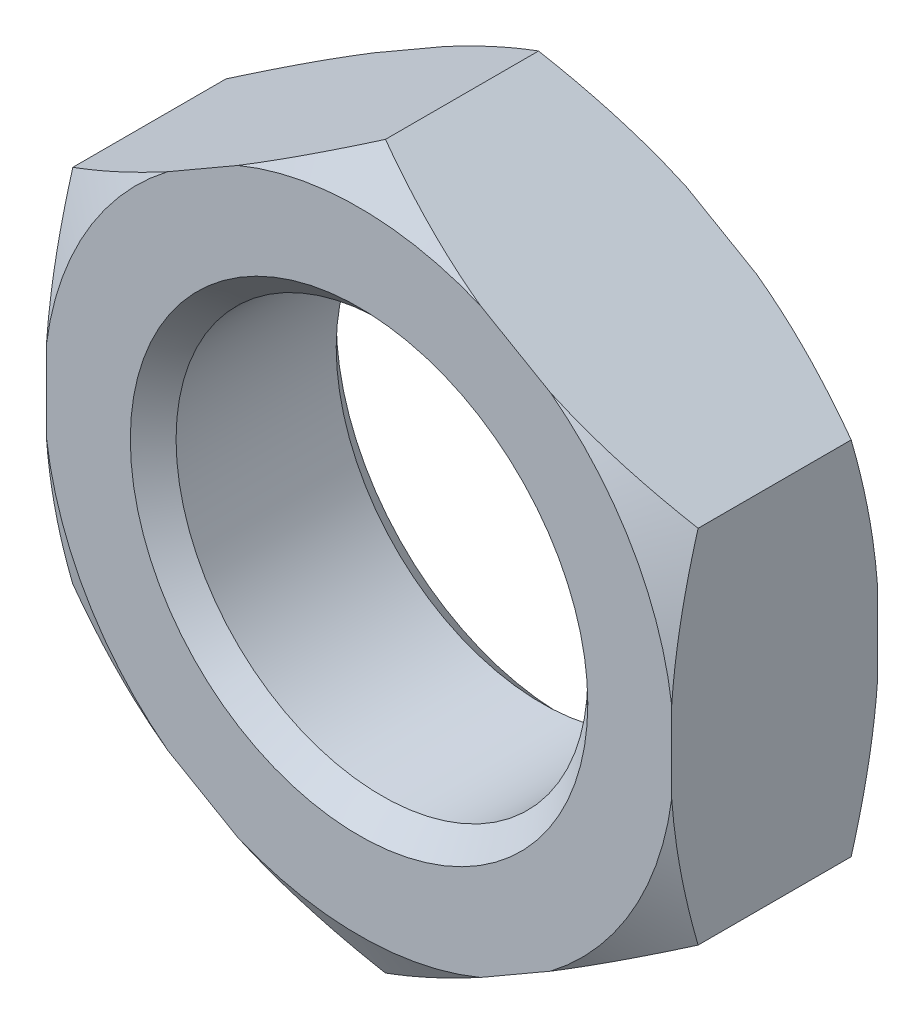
ISO-10303-21;
HEADER;
FILE_DESCRIPTION(('STEP AP214'),'2;1');
FILE_NAME('part.step','',(''),(''),'','','');
FILE_SCHEMA(('AUTOMOTIVE_DESIGN { 1 0 10303 214 1 1 1 1 }'));
ENDSEC;
DATA;
#1=APPLICATION_CONTEXT('core data for automotive mechanical design processes');
#2=APPLICATION_PROTOCOL_DEFINITION('international standard','automotive_design',2000,#1);
#3=PRODUCT_CONTEXT('',#1,'mechanical');
#4=PRODUCT('Part','Part','',(#3));
#5=PRODUCT_RELATED_PRODUCT_CATEGORY('part','',(#4));
#6=PRODUCT_DEFINITION_FORMATION('','',#4);
#7=PRODUCT_DEFINITION_CONTEXT('part definition',#1,'design');
#8=PRODUCT_DEFINITION('design','',#6,#7);
#9=PRODUCT_DEFINITION_SHAPE('','',#8);
#10=(LENGTH_UNIT() NAMED_UNIT(*) SI_UNIT(.MILLI.,.METRE.));
#11=(NAMED_UNIT(*) PLANE_ANGLE_UNIT() SI_UNIT($,.RADIAN.));
#12=(NAMED_UNIT(*) SI_UNIT($,.STERADIAN.) SOLID_ANGLE_UNIT());
#13=UNCERTAINTY_MEASURE_WITH_UNIT(LENGTH_MEASURE(1.E-05),#10,'distance_accuracy_value','');
#14=(GEOMETRIC_REPRESENTATION_CONTEXT(3) GLOBAL_UNCERTAINTY_ASSIGNED_CONTEXT((#13)) GLOBAL_UNIT_ASSIGNED_CONTEXT((#10,
#11,#12)) REPRESENTATION_CONTEXT('',''));
#15=CARTESIAN_POINT('',(0.,0.,0.));
#16=DIRECTION('',(0.,0.,1.));
#17=DIRECTION('',(1.,0.,0.));
#18=AXIS2_PLACEMENT_3D('',#15,#16,#17);
#19=CARTESIAN_POINT('',(20.5,11.8356805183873,6.75));
#20=DIRECTION('',(-0.5,-0.866025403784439,0.));
#21=DIRECTION('',(0.866025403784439,-0.5,0.));
#22=AXIS2_PLACEMENT_3D('',#19,#20,#21);
#23=PLANE('',#22);
#24=CARTESIAN_POINT('',(-14.2409864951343,31.8933984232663,1.4813171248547));
#25=CARTESIAN_POINT('',(-13.9189281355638,31.7074579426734,1.30748385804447));
#26=CARTESIAN_POINT('',(-13.5964796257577,31.5212922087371,1.13461500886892));
#27=CARTESIAN_POINT('',(-12.9507339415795,31.1484707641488,0.790994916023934));
#28=CARTESIAN_POINT('',(-12.6274367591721,30.9618150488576,0.620243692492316));
#29=CARTESIAN_POINT('',(-11.6561034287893,30.4010154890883,0.111415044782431));
#30=CARTESIAN_POINT('',(-11.0067004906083,30.026082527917,-0.223196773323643));
#31=CARTESIAN_POINT('',(-9.70158396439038,29.2725731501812,-0.882354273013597));
#32=CARTESIAN_POINT('',(-9.04585681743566,28.8939889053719,-1.20686423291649));
#33=CARTESIAN_POINT('',(-7.72949167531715,28.133985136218,-1.84229493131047));
#34=CARTESIAN_POINT('',(-7.06885383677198,27.7525657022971,-2.15321610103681));
#35=CARTESIAN_POINT('',(-5.72499220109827,26.9766868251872,-2.76619091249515));
#36=CARTESIAN_POINT('',(-5.04162159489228,26.5821426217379,-3.06781725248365));
#37=CARTESIAN_POINT('',(-3.6679821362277,25.7890715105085,-3.64959958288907));
#38=CARTESIAN_POINT('',(-2.97771294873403,25.3905444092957,-3.92975452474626));
#39=CARTESIAN_POINT('',(-1.59014658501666,24.589432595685,-4.46326026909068));
#40=CARTESIAN_POINT('',(-0.89285689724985,24.1868522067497,-4.71663687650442));
#41=CARTESIAN_POINT('',(0.510003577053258,23.3769103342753,-5.19075414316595));
#42=CARTESIAN_POINT('',(1.21557328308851,22.9695494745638,-5.41149901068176));
#43=CARTESIAN_POINT('',(2.41398390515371,22.2776467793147,-5.75068006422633));
#44=CARTESIAN_POINT('',(2.90460738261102,21.994385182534,-5.87956301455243));
#45=CARTESIAN_POINT('',(3.88970625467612,21.4256380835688,-6.11605302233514));
#46=CARTESIAN_POINT('',(4.38418156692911,21.1401526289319,-6.22366053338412));
#47=CARTESIAN_POINT('',(5.3764560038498,20.5672627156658,-6.41516789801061));
#48=CARTESIAN_POINT('',(5.87425423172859,20.2798587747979,-6.49907390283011));
#49=CARTESIAN_POINT('',(6.87262545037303,19.7034488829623,-6.64105800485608));
#50=CARTESIAN_POINT('',(7.37319841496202,19.4144429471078,-6.69913634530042));
#51=CARTESIAN_POINT('',(8.37035554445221,18.8387340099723,-6.78729128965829));
#52=CARTESIAN_POINT('',(8.86691848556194,18.552043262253,-6.81768537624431));
#53=CARTESIAN_POINT('',(9.8607373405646,17.9782616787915,-6.85071462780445));
#54=CARTESIAN_POINT('',(10.357993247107,17.6911708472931,-6.8533500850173));
#55=CARTESIAN_POINT('',(11.3520253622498,17.1172661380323,-6.83077947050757));
#56=CARTESIAN_POINT('',(11.8488015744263,16.8304522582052,-6.80557360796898));
#57=CARTESIAN_POINT('',(12.8408198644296,16.2577102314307,-6.72808313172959));
#58=CARTESIAN_POINT('',(13.336061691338,15.9717822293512,-6.67579430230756));
#59=CARTESIAN_POINT('',(14.505618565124,15.2965382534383,-6.52165616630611));
#60=CARTESIAN_POINT('',(15.1788397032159,14.9078538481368,-6.40865424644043));
#61=CARTESIAN_POINT('',(16.5188482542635,14.134199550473,-6.13999268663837));
#62=CARTESIAN_POINT('',(17.1856347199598,13.7492302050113,-5.98432686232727));
#63=CARTESIAN_POINT('',(18.5126886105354,12.9830552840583,-5.63621314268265));
#64=CARTESIAN_POINT('',(19.1729477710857,12.6018544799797,-5.44372367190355));
#65=CARTESIAN_POINT('',(20.4860580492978,11.8437299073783,-5.02802775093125));
#66=CARTESIAN_POINT('',(21.1389096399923,11.4668058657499,-4.80482327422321));
#67=CARTESIAN_POINT('',(22.4453992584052,10.7125037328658,-4.3301874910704));
#68=CARTESIAN_POINT('',(23.0989534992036,10.3351740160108,-4.07845081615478));
#69=CARTESIAN_POINT('',(24.3991376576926,9.5845123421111,-3.55380858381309));
#70=CARTESIAN_POINT('',(25.0457718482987,9.21117791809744,-3.28091706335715));
#71=CARTESIAN_POINT('',(26.3331080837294,8.46793399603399,-2.71773235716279));
#72=CARTESIAN_POINT('',(26.9738116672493,8.098023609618,-2.42744383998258));
#73=CARTESIAN_POINT('',(28.2502670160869,7.36106177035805,-1.83246297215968));
#74=CARTESIAN_POINT('',(28.8860181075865,6.99401070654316,-1.5277687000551));
#75=CARTESIAN_POINT('',(29.9607373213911,6.37352127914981,-1.00083207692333));
#76=CARTESIAN_POINT('',(30.4008354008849,6.11943053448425,-0.781649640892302));
#77=CARTESIAN_POINT('',(31.2790955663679,5.6123667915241,-0.338219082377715));
#78=CARTESIAN_POINT('',(31.7172577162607,5.35939375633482,-0.113971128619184));
#79=CARTESIAN_POINT('',(32.5872155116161,4.85712338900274,0.33659353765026));
#80=CARTESIAN_POINT('',(33.019029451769,4.60781549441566,0.562863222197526));
#81=CARTESIAN_POINT('',(33.8811219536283,4.11008615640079,1.01929385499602));
#82=CARTESIAN_POINT('',(34.3114004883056,3.86166472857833,1.24945487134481));
#83=CARTESIAN_POINT('',(34.7409864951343,3.6136431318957,1.4813171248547));
#84=B_SPLINE_CURVE_WITH_KNOTS('',3,(#24,#25,#26,#27,#28,#29,#30,#31,#32,#33,#34,#35,#36,#37,#38,
#39,#40,#41,#42,#43,#44,#45,#46,#47,#48,#49,#50,#51,#52,#53,#54,#55,#56,#57,#58,#59,#60,#61,#62,
#63,#64,#65,#66,#67,#68,#69,#70,#71,#72,#73,#74,#75,#76,#77,#78,#79,#80,#81,#82,#83),
.UNSPECIFIED.,.F.,.F.,(4,2,2,2,2,2,2,2,2,2,2,2,2,2,2,2,2,2,2,2,2,2,2,2,2,2,2,2,2,4),(0.,
1.2315091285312,2.46302995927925,4.92635850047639,7.39758656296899,9.86873614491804,
12.4028003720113,14.9369882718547,17.4687113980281,20.0001077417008,21.7427572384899,
23.4853695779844,25.2275292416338,26.9696724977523,28.6915756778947,30.4134607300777,
32.1353328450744,33.8574730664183,36.2126656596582,38.5681998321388,40.9264093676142,
43.2844674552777,45.6706973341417,48.0553572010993,50.4393799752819,52.823721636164,
54.4839971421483,56.1442174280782,57.7868630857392,59.4295375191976),.UNSPECIFIED.);
#85=CARTESIAN_POINT('',(0.,23.6713610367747,-5.01794919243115));
#86=VERTEX_POINT('',#85);
#87=CARTESIAN_POINT('',(7.94970103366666,19.0815990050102,-6.75));
#88=VERTEX_POINT('',#87);
#89=EDGE_CURVE('E177',#86,#88,#84,.T.);
#90=ORIENTED_EDGE('',*,*,#89,.F.);
#91=DIRECTION('',(0.,0.,-1.));
#92=VECTOR('',#91,1.);
#93=CARTESIAN_POINT('',(0.,23.6713610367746,6.75));
#94=LINE('',#93,#92);
#95=CARTESIAN_POINT('',(0.,23.6713610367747,5.01794919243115));
#96=VERTEX_POINT('',#95);
#97=EDGE_CURVE('E223',#96,#86,#94,.T.);
#98=ORIENTED_EDGE('',*,*,#97,.F.);
#99=CARTESIAN_POINT('',(34.7409864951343,3.6136431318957,-1.4813171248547));
#100=CARTESIAN_POINT('',(34.4189281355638,3.79958361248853,-1.30748385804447));
#101=CARTESIAN_POINT('',(34.0964796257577,3.98574934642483,-1.13461500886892));
#102=CARTESIAN_POINT('',(33.4507339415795,4.35857079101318,-0.790994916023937));
#103=CARTESIAN_POINT('',(33.1274367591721,4.54522650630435,-0.620243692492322));
#104=CARTESIAN_POINT('',(32.1561034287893,5.10602606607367,-0.111415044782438));
#105=CARTESIAN_POINT('',(31.5067004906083,5.48095902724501,0.223196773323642));
#106=CARTESIAN_POINT('',(30.2015839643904,6.23446840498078,0.882354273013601));
#107=CARTESIAN_POINT('',(29.5458568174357,6.61305264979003,1.20686423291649));
#108=CARTESIAN_POINT('',(28.2294916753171,7.373056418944,1.84229493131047));
#109=CARTESIAN_POINT('',(27.568853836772,7.7544758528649,2.15321610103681));
#110=CARTESIAN_POINT('',(26.2249922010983,8.53035472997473,2.76619091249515));
#111=CARTESIAN_POINT('',(25.5416215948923,8.92489893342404,3.06781725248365));
#112=CARTESIAN_POINT('',(24.1679821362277,9.71797004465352,3.64959958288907));
#113=CARTESIAN_POINT('',(23.477712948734,10.1164971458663,3.92975452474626));
#114=CARTESIAN_POINT('',(22.0901465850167,10.917608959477,4.46326026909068));
#115=CARTESIAN_POINT('',(21.3928568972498,11.3201893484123,4.71663687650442));
#116=CARTESIAN_POINT('',(19.9899964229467,12.1301312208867,5.19075414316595));
#117=CARTESIAN_POINT('',(19.2844267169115,12.5374920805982,5.41149901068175));
#118=CARTESIAN_POINT('',(18.0860160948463,13.2293947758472,5.75068006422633));
#119=CARTESIAN_POINT('',(17.595392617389,13.512656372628,5.87956301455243));
#120=CARTESIAN_POINT('',(16.6102937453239,14.0814034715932,6.11605302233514));
#121=CARTESIAN_POINT('',(16.1158184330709,14.36688892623,6.22366053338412));
#122=CARTESIAN_POINT('',(15.1235439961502,14.9397788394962,6.41516789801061));
#123=CARTESIAN_POINT('',(14.6257457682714,15.2271827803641,6.49907390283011));
#124=CARTESIAN_POINT('',(13.627374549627,15.8035926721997,6.64105800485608));
#125=CARTESIAN_POINT('',(13.126801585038,16.0925986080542,6.69913634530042));
#126=CARTESIAN_POINT('',(12.1296444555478,16.6683075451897,6.78729128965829));
#127=CARTESIAN_POINT('',(11.6330815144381,16.954998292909,6.81768537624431));
#128=CARTESIAN_POINT('',(10.6392626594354,17.5287798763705,6.85071462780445));
#129=CARTESIAN_POINT('',(10.142006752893,17.8158707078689,6.8533500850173));
#130=CARTESIAN_POINT('',(9.14797463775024,18.3897754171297,6.83077947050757));
#131=CARTESIAN_POINT('',(8.65119842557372,18.6765892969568,6.80557360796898));
#132=CARTESIAN_POINT('',(7.65918013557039,19.2493313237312,6.72808313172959));
#133=CARTESIAN_POINT('',(7.16393830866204,19.5352593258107,6.67579430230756));
#134=CARTESIAN_POINT('',(5.994381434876,20.2105033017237,6.52165616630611));
#135=CARTESIAN_POINT('',(5.32116029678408,20.5991877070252,6.40865424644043));
#136=CARTESIAN_POINT('',(3.98115174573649,21.3728420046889,6.13999268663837));
#137=CARTESIAN_POINT('',(3.31436528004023,21.7578113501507,5.98432686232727));
#138=CARTESIAN_POINT('',(1.98731138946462,22.5239862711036,5.63621314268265));
#139=CARTESIAN_POINT('',(1.32705222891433,22.9051870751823,5.44372367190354));
#140=CARTESIAN_POINT('',(0.0139419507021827,23.6633116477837,5.02802775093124));
#141=CARTESIAN_POINT('',(-0.638909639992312,24.0402356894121,4.8048232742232));
#142=CARTESIAN_POINT('',(-1.9453992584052,24.7945378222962,4.3301874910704));
#143=CARTESIAN_POINT('',(-2.59895349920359,25.1718675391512,4.07845081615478));
#144=CARTESIAN_POINT('',(-3.8991376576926,25.9225292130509,3.55380858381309));
#145=CARTESIAN_POINT('',(-4.54577184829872,26.2958636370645,3.28091706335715));
#146=CARTESIAN_POINT('',(-5.83310808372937,27.039107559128,2.71773235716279));
#147=CARTESIAN_POINT('',(-6.47381166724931,27.409017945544,2.42744383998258));
#148=CARTESIAN_POINT('',(-7.75026701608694,28.1459797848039,1.83246297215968));
#149=CARTESIAN_POINT('',(-8.38601810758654,28.5130308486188,1.5277687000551));
#150=CARTESIAN_POINT('',(-9.46073732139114,29.1335202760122,1.00083207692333));
#151=CARTESIAN_POINT('',(-9.90083540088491,29.3876110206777,0.781649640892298));
#152=CARTESIAN_POINT('',(-10.7790955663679,29.8946747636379,0.338219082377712));
#153=CARTESIAN_POINT('',(-11.2172577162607,30.1476477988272,0.11397112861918));
#154=CARTESIAN_POINT('',(-12.0872155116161,30.6499181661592,-0.336593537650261));
#155=CARTESIAN_POINT('',(-12.519029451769,30.8992260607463,-0.562863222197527));
#156=CARTESIAN_POINT('',(-13.3811219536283,31.3969553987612,-1.01929385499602));
#157=CARTESIAN_POINT('',(-13.8114004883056,31.6453768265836,-1.24945487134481));
#158=CARTESIAN_POINT('',(-14.2409864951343,31.8933984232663,-1.4813171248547));
#159=B_SPLINE_CURVE_WITH_KNOTS('',3,(#99,#100,#101,#102,#103,#104,#105,#106,#107,#108,#109,#110,
#111,#112,#113,#114,#115,#116,#117,#118,#119,#120,#121,#122,#123,#124,#125,#126,#127,#128,#129,
#130,#131,#132,#133,#134,#135,#136,#137,#138,#139,#140,#141,#142,#143,#144,#145,#146,#147,#148,
#149,#150,#151,#152,#153,#154,#155,#156,#157,#158),.UNSPECIFIED.,.F.,.F.,(4,2,2,2,2,2,2,2,2,2,2,
2,2,2,2,2,2,2,2,2,2,2,2,2,2,2,2,2,2,4),(0.,1.2315091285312,2.46302995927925,4.92635850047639,
7.397586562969,9.86873614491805,12.4028003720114,14.9369882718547,17.4687113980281,
20.0001077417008,21.7427572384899,23.4853695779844,25.2275292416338,26.9696724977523,
28.6915756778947,30.4134607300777,32.1353328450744,33.8574730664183,36.2126656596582,
38.5681998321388,40.9264093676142,43.2844674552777,45.6706973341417,48.0553572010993,
50.4393799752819,52.823721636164,54.4839971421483,56.1442174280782,57.7868630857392,
59.4295375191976),.UNSPECIFIED.);
#160=CARTESIAN_POINT('',(7.94970103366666,19.0815990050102,6.75));
#161=VERTEX_POINT('',#160);
#162=EDGE_CURVE('E373',#161,#96,#159,.T.);
#163=ORIENTED_EDGE('',*,*,#162,.F.);
#164=DIRECTION('',(-0.866025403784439,0.5,0.));
#165=VECTOR('',#164,1.);
#166=CARTESIAN_POINT('',(20.5,11.8356805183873,6.75));
#167=LINE('',#166,#165);
#168=CARTESIAN_POINT('',(12.5502989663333,16.4254425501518,6.75));
#169=VERTEX_POINT('',#168);
#170=EDGE_CURVE('E352',#169,#161,#167,.T.);
#171=ORIENTED_EDGE('',*,*,#170,.F.);
#172=CARTESIAN_POINT('',(20.5,11.8356805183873,5.01794919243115));
#173=VERTEX_POINT('',#172);
#174=EDGE_CURVE('E194',#173,#169,#159,.T.);
#175=ORIENTED_EDGE('',*,*,#174,.F.);
#176=DIRECTION('',(0.,0.,-1.));
#177=VECTOR('',#176,1.);
#178=CARTESIAN_POINT('',(20.5,11.8356805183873,6.75));
#179=LINE('',#178,#177);
#180=CARTESIAN_POINT('',(20.5,11.8356805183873,-5.01794919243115));
#181=VERTEX_POINT('',#180);
#182=EDGE_CURVE('E183',#173,#181,#179,.T.);
#183=ORIENTED_EDGE('',*,*,#182,.T.);
#184=CARTESIAN_POINT('',(12.5502989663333,16.4254425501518,-6.75));
#185=VERTEX_POINT('',#184);
#186=EDGE_CURVE('E164',#185,#181,#84,.T.);
#187=ORIENTED_EDGE('',*,*,#186,.F.);
#188=DIRECTION('',(-0.866025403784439,0.5,0.));
#189=VECTOR('',#188,1.);
#190=CARTESIAN_POINT('',(20.5,11.8356805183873,-6.75));
#191=LINE('',#190,#189);
#192=EDGE_CURVE('E266',#185,#88,#191,.T.);
#193=ORIENTED_EDGE('',*,*,#192,.T.);
#194=EDGE_LOOP('',(#90,#98,#163,#171,#175,#183,#187,#193));
#195=FACE_BOUND('',#194,.T.);
#196=ADVANCED_FACE('F39',(#195),#23,.F.);
#197=CARTESIAN_POINT('',(0.,23.6713610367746,6.75));
#198=DIRECTION('',(0.5,-0.866025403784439,0.));
#199=DIRECTION('',(0.866025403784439,0.5,0.));
#200=AXIS2_PLACEMENT_3D('',#197,#198,#199);
#201=PLANE('',#200);
#202=CARTESIAN_POINT('',(-34.7409864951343,3.6136431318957,1.4813171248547));
#203=CARTESIAN_POINT('',(-34.4189281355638,3.79958361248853,1.30748385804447));
#204=CARTESIAN_POINT('',(-34.0964796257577,3.98574934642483,1.13461500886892));
#205=CARTESIAN_POINT('',(-33.4507339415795,4.35857079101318,0.790994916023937));
#206=CARTESIAN_POINT('',(-33.1274367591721,4.54522650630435,0.620243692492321));
#207=CARTESIAN_POINT('',(-32.1561034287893,5.10602606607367,0.111415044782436));
#208=CARTESIAN_POINT('',(-31.5067004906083,5.48095902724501,-0.223196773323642));
#209=CARTESIAN_POINT('',(-30.2015839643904,6.23446840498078,-0.882354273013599));
#210=CARTESIAN_POINT('',(-29.5458568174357,6.61305264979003,-1.20686423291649));
#211=CARTESIAN_POINT('',(-28.2294916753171,7.373056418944,-1.84229493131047));
#212=CARTESIAN_POINT('',(-27.568853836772,7.7544758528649,-2.15321610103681));
#213=CARTESIAN_POINT('',(-26.2249922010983,8.53035472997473,-2.76619091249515));
#214=CARTESIAN_POINT('',(-25.5416215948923,8.92489893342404,-3.06781725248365));
#215=CARTESIAN_POINT('',(-24.1679821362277,9.71797004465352,-3.64959958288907));
#216=CARTESIAN_POINT('',(-23.477712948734,10.1164971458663,-3.92975452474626));
#217=CARTESIAN_POINT('',(-22.0901465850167,10.917608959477,-4.46326026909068));
#218=CARTESIAN_POINT('',(-21.3928568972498,11.3201893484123,-4.71663687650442));
#219=CARTESIAN_POINT('',(-19.9899964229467,12.1301312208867,-5.19075414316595));
#220=CARTESIAN_POINT('',(-19.2844267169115,12.5374920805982,-5.41149901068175));
#221=CARTESIAN_POINT('',(-18.0860160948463,13.2293947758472,-5.75068006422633));
#222=CARTESIAN_POINT('',(-17.595392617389,13.512656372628,-5.87956301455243));
#223=CARTESIAN_POINT('',(-16.6102937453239,14.0814034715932,-6.11605302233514));
#224=CARTESIAN_POINT('',(-16.1158184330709,14.36688892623,-6.22366053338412));
#225=CARTESIAN_POINT('',(-15.1235439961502,14.9397788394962,-6.41516789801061));
#226=CARTESIAN_POINT('',(-14.6257457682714,15.2271827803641,-6.49907390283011));
#227=CARTESIAN_POINT('',(-13.627374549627,15.8035926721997,-6.64105800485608));
#228=CARTESIAN_POINT('',(-13.126801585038,16.0925986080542,-6.69913634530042));
#229=CARTESIAN_POINT('',(-12.1296444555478,16.6683075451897,-6.78729128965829));
#230=CARTESIAN_POINT('',(-11.633081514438,16.954998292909,-6.81768537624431));
#231=CARTESIAN_POINT('',(-10.6392626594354,17.5287798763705,-6.85071462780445));
#232=CARTESIAN_POINT('',(-10.142006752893,17.8158707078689,-6.8533500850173));
#233=CARTESIAN_POINT('',(-9.14797463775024,18.3897754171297,-6.83077947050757));
#234=CARTESIAN_POINT('',(-8.65119842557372,18.6765892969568,-6.80557360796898));
#235=CARTESIAN_POINT('',(-7.65918013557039,19.2493313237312,-6.72808313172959));
#236=CARTESIAN_POINT('',(-7.16393830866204,19.5352593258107,-6.67579430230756));
#237=CARTESIAN_POINT('',(-5.994381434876,20.2105033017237,-6.52165616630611));
#238=CARTESIAN_POINT('',(-5.32116029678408,20.5991877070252,-6.40865424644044));
#239=CARTESIAN_POINT('',(-3.98115174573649,21.3728420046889,-6.13999268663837));
#240=CARTESIAN_POINT('',(-3.31436528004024,21.7578113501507,-5.98432686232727));
#241=CARTESIAN_POINT('',(-1.98731138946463,22.5239862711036,-5.63621314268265));
#242=CARTESIAN_POINT('',(-1.32705222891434,22.9051870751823,-5.44372367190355));
#243=CARTESIAN_POINT('',(-0.0139419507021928,23.6633116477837,-5.02802775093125));
#244=CARTESIAN_POINT('',(0.638909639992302,24.0402356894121,-4.80482327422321));
#245=CARTESIAN_POINT('',(1.94539925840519,24.7945378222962,-4.33018749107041));
#246=CARTESIAN_POINT('',(2.59895349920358,25.1718675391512,-4.07845081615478));
#247=CARTESIAN_POINT('',(3.89913765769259,25.9225292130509,-3.55380858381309));
#248=CARTESIAN_POINT('',(4.54577184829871,26.2958636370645,-3.28091706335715));
#249=CARTESIAN_POINT('',(5.83310808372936,27.039107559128,-2.71773235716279));
#250=CARTESIAN_POINT('',(6.4738116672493,27.409017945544,-2.42744383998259));
#251=CARTESIAN_POINT('',(7.75026701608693,28.1459797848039,-1.83246297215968));
#252=CARTESIAN_POINT('',(8.38601810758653,28.5130308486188,-1.5277687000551));
#253=CARTESIAN_POINT('',(9.46073732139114,29.1335202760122,-1.00083207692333));
#254=CARTESIAN_POINT('',(9.9008354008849,29.3876110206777,-0.781649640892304));
#255=CARTESIAN_POINT('',(10.7790955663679,29.8946747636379,-0.338219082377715));
#256=CARTESIAN_POINT('',(11.2172577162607,30.1476477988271,-0.113971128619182));
#257=CARTESIAN_POINT('',(12.0872155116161,30.6499181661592,0.336593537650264));
#258=CARTESIAN_POINT('',(12.519029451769,30.8992260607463,0.562863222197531));
#259=CARTESIAN_POINT('',(13.3811219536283,31.3969553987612,1.01929385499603));
#260=CARTESIAN_POINT('',(13.8114004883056,31.6453768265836,1.24945487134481));
#261=CARTESIAN_POINT('',(14.2409864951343,31.8933984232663,1.4813171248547));
#262=B_SPLINE_CURVE_WITH_KNOTS('',3,(#202,#203,#204,#205,#206,#207,#208,#209,#210,#211,#212,
#213,#214,#215,#216,#217,#218,#219,#220,#221,#222,#223,#224,#225,#226,#227,#228,#229,#230,#231,
#232,#233,#234,#235,#236,#237,#238,#239,#240,#241,#242,#243,#244,#245,#246,#247,#248,#249,#250,
#251,#252,#253,#254,#255,#256,#257,#258,#259,#260,#261),.UNSPECIFIED.,.F.,.F.,(4,2,2,2,2,2,2,2,
2,2,2,2,2,2,2,2,2,2,2,2,2,2,2,2,2,2,2,2,2,4),(0.,1.2315091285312,2.46302995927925,
4.92635850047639,7.397586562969,9.86873614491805,12.4028003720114,14.9369882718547,
17.4687113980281,20.0001077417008,21.7427572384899,23.4853695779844,25.2275292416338,
26.9696724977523,28.6915756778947,30.4134607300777,32.1353328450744,33.8574730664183,
36.2126656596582,38.5681998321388,40.9264093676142,43.2844674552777,45.6706973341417,
48.0553572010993,50.4393799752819,52.823721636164,54.4839971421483,56.1442174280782,
57.7868630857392,59.4295375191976),.UNSPECIFIED.);
#263=CARTESIAN_POINT('',(-20.5,11.8356805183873,-5.01794919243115));
#264=VERTEX_POINT('',#263);
#265=CARTESIAN_POINT('',(-12.5502989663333,16.4254425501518,-6.75));
#266=VERTEX_POINT('',#265);
#267=EDGE_CURVE('E55',#264,#266,#262,.T.);
#268=ORIENTED_EDGE('',*,*,#267,.F.);
#269=DIRECTION('',(0.,0.,-1.));
#270=VECTOR('',#269,1.);
#271=CARTESIAN_POINT('',(-20.5,11.8356805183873,6.75));
#272=LINE('',#271,#270);
#273=CARTESIAN_POINT('',(-20.5,11.8356805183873,5.01794919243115));
#274=VERTEX_POINT('',#273);
#275=EDGE_CURVE('E219',#274,#264,#272,.T.);
#276=ORIENTED_EDGE('',*,*,#275,.F.);
#277=CARTESIAN_POINT('',(14.2409864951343,31.8933984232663,-1.4813171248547));
#278=CARTESIAN_POINT('',(13.9189281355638,31.7074579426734,-1.30748385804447));
#279=CARTESIAN_POINT('',(13.5964796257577,31.5212922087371,-1.13461500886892));
#280=CARTESIAN_POINT('',(12.9507339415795,31.1484707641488,-0.790994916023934));
#281=CARTESIAN_POINT('',(12.6274367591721,30.9618150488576,-0.620243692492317));
#282=CARTESIAN_POINT('',(11.6561034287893,30.4010154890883,-0.111415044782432));
#283=CARTESIAN_POINT('',(11.0067004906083,30.026082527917,0.223196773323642));
#284=CARTESIAN_POINT('',(9.70158396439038,29.2725731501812,0.882354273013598));
#285=CARTESIAN_POINT('',(9.04585681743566,28.8939889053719,1.20686423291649));
#286=CARTESIAN_POINT('',(7.72949167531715,28.133985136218,1.84229493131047));
#287=CARTESIAN_POINT('',(7.06885383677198,27.7525657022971,2.15321610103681));
#288=CARTESIAN_POINT('',(5.72499220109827,26.9766868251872,2.76619091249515));
#289=CARTESIAN_POINT('',(5.04162159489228,26.5821426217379,3.06781725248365));
#290=CARTESIAN_POINT('',(3.6679821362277,25.7890715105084,3.64959958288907));
#291=CARTESIAN_POINT('',(2.97771294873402,25.3905444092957,3.92975452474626));
#292=CARTESIAN_POINT('',(1.59014658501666,24.589432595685,4.46326026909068));
#293=CARTESIAN_POINT('',(0.892856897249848,24.1868522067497,4.71663687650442));
#294=CARTESIAN_POINT('',(-0.510003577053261,23.3769103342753,5.19075414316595));
#295=CARTESIAN_POINT('',(-1.21557328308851,22.9695494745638,5.41149901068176));
#296=CARTESIAN_POINT('',(-2.41398390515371,22.2776467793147,5.75068006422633));
#297=CARTESIAN_POINT('',(-2.90460738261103,21.994385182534,5.87956301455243));
#298=CARTESIAN_POINT('',(-3.88970625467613,21.4256380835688,6.11605302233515));
#299=CARTESIAN_POINT('',(-4.38418156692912,21.1401526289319,6.22366053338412));
#300=CARTESIAN_POINT('',(-5.37645600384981,20.5672627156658,6.41516789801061));
#301=CARTESIAN_POINT('',(-5.8742542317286,20.2798587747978,6.49907390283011));
#302=CARTESIAN_POINT('',(-6.87262545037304,19.7034488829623,6.64105800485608));
#303=CARTESIAN_POINT('',(-7.37319841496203,19.4144429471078,6.69913634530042));
#304=CARTESIAN_POINT('',(-8.37035554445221,18.8387340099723,6.78729128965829));
#305=CARTESIAN_POINT('',(-8.86691848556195,18.552043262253,6.81768537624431));
#306=CARTESIAN_POINT('',(-9.86073734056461,17.9782616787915,6.85071462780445));
#307=CARTESIAN_POINT('',(-10.357993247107,17.6911708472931,6.8533500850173));
#308=CARTESIAN_POINT('',(-11.3520253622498,17.1172661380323,6.83077947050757));
#309=CARTESIAN_POINT('',(-11.8488015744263,16.8304522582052,6.80557360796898));
#310=CARTESIAN_POINT('',(-12.8408198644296,16.2577102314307,6.72808313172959));
#311=CARTESIAN_POINT('',(-13.336061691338,15.9717822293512,6.67579430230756));
#312=CARTESIAN_POINT('',(-14.505618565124,15.2965382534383,6.52165616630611));
#313=CARTESIAN_POINT('',(-15.1788397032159,14.9078538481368,6.40865424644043));
#314=CARTESIAN_POINT('',(-16.5188482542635,14.134199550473,6.13999268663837));
#315=CARTESIAN_POINT('',(-17.1856347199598,13.7492302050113,5.98432686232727));
#316=CARTESIAN_POINT('',(-18.5126886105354,12.9830552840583,5.63621314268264));
#317=CARTESIAN_POINT('',(-19.1729477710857,12.6018544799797,5.44372367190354));
#318=CARTESIAN_POINT('',(-20.4860580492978,11.8437299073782,5.02802775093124));
#319=CARTESIAN_POINT('',(-21.1389096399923,11.4668058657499,4.8048232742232));
#320=CARTESIAN_POINT('',(-22.4453992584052,10.7125037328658,4.33018749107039));
#321=CARTESIAN_POINT('',(-23.0989534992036,10.3351740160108,4.07845081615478));
#322=CARTESIAN_POINT('',(-24.3991376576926,9.58451234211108,3.55380858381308));
#323=CARTESIAN_POINT('',(-25.0457718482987,9.21117791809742,3.28091706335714));
#324=CARTESIAN_POINT('',(-26.3331080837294,8.46793399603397,2.71773235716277));
#325=CARTESIAN_POINT('',(-26.9738116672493,8.09802360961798,2.42744383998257));
#326=CARTESIAN_POINT('',(-28.250267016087,7.36106177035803,1.83246297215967));
#327=CARTESIAN_POINT('',(-28.8860181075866,6.99401070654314,1.52776870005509));
#328=CARTESIAN_POINT('',(-29.9607373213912,6.37352127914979,1.00083207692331));
#329=CARTESIAN_POINT('',(-30.4008354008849,6.11943053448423,0.78164964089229));
#330=CARTESIAN_POINT('',(-31.2790955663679,5.61236679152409,0.338219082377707));
#331=CARTESIAN_POINT('',(-31.7172577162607,5.35939375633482,0.113971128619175));
#332=CARTESIAN_POINT('',(-32.5872155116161,4.85712338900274,-0.336593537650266));
#333=CARTESIAN_POINT('',(-33.019029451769,4.60781549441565,-0.562863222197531));
#334=CARTESIAN_POINT('',(-33.8811219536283,4.11008615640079,-1.01929385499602));
#335=CARTESIAN_POINT('',(-34.3114004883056,3.86166472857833,-1.24945487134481));
#336=CARTESIAN_POINT('',(-34.7409864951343,3.6136431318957,-1.4813171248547));
#337=B_SPLINE_CURVE_WITH_KNOTS('',3,(#277,#278,#279,#280,#281,#282,#283,#284,#285,#286,#287,
#288,#289,#290,#291,#292,#293,#294,#295,#296,#297,#298,#299,#300,#301,#302,#303,#304,#305,#306,
#307,#308,#309,#310,#311,#312,#313,#314,#315,#316,#317,#318,#319,#320,#321,#322,#323,#324,#325,
#326,#327,#328,#329,#330,#331,#332,#333,#334,#335,#336),.UNSPECIFIED.,.F.,.F.,(4,2,2,2,2,2,2,2,
2,2,2,2,2,2,2,2,2,2,2,2,2,2,2,2,2,2,2,2,2,4),(0.,1.2315091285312,2.46302995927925,
4.9263585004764,7.397586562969,9.86873614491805,12.4028003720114,14.9369882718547,
17.4687113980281,20.0001077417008,21.7427572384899,23.4853695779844,25.2275292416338,
26.9696724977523,28.6915756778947,30.4134607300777,32.1353328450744,33.8574730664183,
36.2126656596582,38.5681998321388,40.9264093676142,43.2844674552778,45.6706973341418,
48.0553572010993,50.4393799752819,52.8237216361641,54.4839971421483,56.1442174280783,
57.7868630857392,59.4295375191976),.UNSPECIFIED.);
#338=CARTESIAN_POINT('',(-12.5502989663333,16.4254425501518,6.75));
#339=VERTEX_POINT('',#338);
#340=EDGE_CURVE('E346',#339,#274,#337,.T.);
#341=ORIENTED_EDGE('',*,*,#340,.F.);
#342=DIRECTION('',(-0.866025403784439,-0.5,0.));
#343=VECTOR('',#342,1.);
#344=CARTESIAN_POINT('',(0.,23.6713610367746,6.75));
#345=LINE('',#344,#343);
#346=CARTESIAN_POINT('',(-7.94970103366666,19.0815990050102,6.75));
#347=VERTEX_POINT('',#346);
#348=EDGE_CURVE('E356',#347,#339,#345,.T.);
#349=ORIENTED_EDGE('',*,*,#348,.F.);
#350=EDGE_CURVE('E351',#96,#347,#337,.T.);
#351=ORIENTED_EDGE('',*,*,#350,.F.);
#352=ORIENTED_EDGE('',*,*,#97,.T.);
#353=CARTESIAN_POINT('',(-7.94970103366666,19.0815990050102,-6.75));
#354=VERTEX_POINT('',#353);
#355=EDGE_CURVE('E406',#354,#86,#262,.T.);
#356=ORIENTED_EDGE('',*,*,#355,.F.);
#357=DIRECTION('',(-0.866025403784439,-0.5,0.));
#358=VECTOR('',#357,1.);
#359=CARTESIAN_POINT('',(0.,23.6713610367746,-6.75));
#360=LINE('',#359,#358);
#361=EDGE_CURVE('E372',#354,#266,#360,.T.);
#362=ORIENTED_EDGE('',*,*,#361,.T.);
#363=EDGE_LOOP('',(#268,#276,#341,#349,#351,#352,#356,#362));
#364=FACE_BOUND('',#363,.T.);
#365=ADVANCED_FACE('F326',(#364),#201,.F.);
#366=CARTESIAN_POINT('',(-20.5,11.8356805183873,6.75));
#367=DIRECTION('',(1.,0.,0.));
#368=DIRECTION('',(0.,0.,-1.));
#369=AXIS2_PLACEMENT_3D('',#366,#367,#368);
#370=PLANE('',#369);
#371=CARTESIAN_POINT('',(-20.5,-26.0766670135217,0.466037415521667));
#372=CARTESIAN_POINT('',(-20.5,-25.7063519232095,0.297959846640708));
#373=CARTESIAN_POINT('',(-20.5,-25.3355252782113,0.131010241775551));
#374=CARTESIAN_POINT('',(-20.5,-24.5927579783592,-0.200405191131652));
#375=CARTESIAN_POINT('',(-20.5,-24.2208173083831,-0.364870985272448));
#376=CARTESIAN_POINT('',(-20.5,-23.1030780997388,-0.854248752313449));
#377=CARTESIAN_POINT('',(-20.5,-22.3554865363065,-1.17508456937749));
#378=CARTESIAN_POINT('',(-20.5,-20.8516512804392,-1.80492037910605));
#379=CARTESIAN_POINT('',(-20.5,-20.0953844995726,-2.11386538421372));
#380=CARTESIAN_POINT('',(-20.5,-18.5764601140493,-2.71558777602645));
#381=CARTESIAN_POINT('',(-20.5,-17.8138028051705,-3.00836590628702));
#382=CARTESIAN_POINT('',(-20.5,-16.2845704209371,-3.57288628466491));
#383=CARTESIAN_POINT('',(-20.5,-15.518027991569,-3.84471653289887));
#384=CARTESIAN_POINT('',(-20.5,-13.9767509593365,-4.36437123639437));
#385=CARTESIAN_POINT('',(-20.5,-13.2020159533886,-4.61219450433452));
#386=CARTESIAN_POINT('',(-20.5,-11.6447192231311,-5.07816291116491));
#387=CARTESIAN_POINT('',(-20.5,-10.862169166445,-5.29634675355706));
#388=CARTESIAN_POINT('',(-20.5,-9.28801286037,-5.69720275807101));
#389=CARTESIAN_POINT('',(-20.5,-8.49640789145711,-5.87987987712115));
#390=CARTESIAN_POINT('',(-20.5,-7.12991866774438,-6.15730640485));
#391=CARTESIAN_POINT('',(-20.5,-6.55711490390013,-6.26230801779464));
#392=CARTESIAN_POINT('',(-20.5,-5.40759100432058,-6.44822552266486));
#393=CARTESIAN_POINT('',(-20.5,-4.83087099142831,-6.52914216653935));
#394=CARTESIAN_POINT('',(-20.5,-3.67447912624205,-6.66475101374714));
#395=CARTESIAN_POINT('',(-20.5,-3.09480805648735,-6.71944983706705));
#396=CARTESIAN_POINT('',(-20.5,-1.93349580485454,-6.80106535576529));
#397=CARTESIAN_POINT('',(-20.5,-1.35185462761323,-6.82798211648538));
#398=CARTESIAN_POINT('',(-20.5,-0.188246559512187,-6.85319416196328));
#399=CARTESIAN_POINT('',(-20.5,0.393720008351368,-6.85150421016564));
#400=CARTESIAN_POINT('',(-20.5,1.55685914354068,-6.81959284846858));
#401=CARTESIAN_POINT('',(-20.5,2.13803171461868,-6.78937157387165));
#402=CARTESIAN_POINT('',(-20.5,3.29832514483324,-6.70132043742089));
#403=CARTESIAN_POINT('',(-20.5,3.87744578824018,-6.6434877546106));
#404=CARTESIAN_POINT('',(-20.5,5.03249015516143,-6.50187860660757));
#405=CARTESIAN_POINT('',(-20.5,5.60841374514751,-6.41810106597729));
#406=CARTESIAN_POINT('',(-20.5,7.04356628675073,-6.1788534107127));
#407=CARTESIAN_POINT('',(-20.5,7.90032356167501,-6.00848733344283));
#408=CARTESIAN_POINT('',(-20.5,9.60355874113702,-5.62240789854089));
#409=CARTESIAN_POINT('',(-20.5,10.450034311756,-5.40668444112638));
#410=CARTESIAN_POINT('',(-20.5,12.1343868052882,-4.93752138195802));
#411=CARTESIAN_POINT('',(-20.5,12.9722405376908,-4.6839993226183));
#412=CARTESIAN_POINT('',(-20.5,14.6380666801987,-4.1467842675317));
#413=CARTESIAN_POINT('',(-20.5,15.4660397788,-3.86309338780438));
#414=CARTESIAN_POINT('',(-20.5,17.1226753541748,-3.26805913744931));
#415=CARTESIAN_POINT('',(-20.5,17.9512366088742,-2.95643568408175));
#416=CARTESIAN_POINT('',(-20.5,19.6006067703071,-2.31325844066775));
#417=CARTESIAN_POINT('',(-20.5,20.421415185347,-1.98170339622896));
#418=CARTESIAN_POINT('',(-20.5,22.0512533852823,-1.30465108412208));
#419=CARTESIAN_POINT('',(-20.5,22.8603246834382,-0.959253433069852));
#420=CARTESIAN_POINT('',(-20.5,24.0695947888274,-0.431525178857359));
#421=CARTESIAN_POINT('',(-20.5,24.4719157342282,-0.254031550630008));
#422=CARTESIAN_POINT('',(-20.5,25.2752459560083,0.103881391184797));
#423=CARTESIAN_POINT('',(-20.5,25.6762552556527,0.284300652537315));
#424=CARTESIAN_POINT('',(-20.5,26.0766670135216,0.466037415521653));
#425=B_SPLINE_CURVE_WITH_KNOTS('',3,(#371,#372,#373,#374,#375,#376,#377,#378,#379,#380,#381,
#382,#383,#384,#385,#386,#387,#388,#389,#390,#391,#392,#393,#394,#395,#396,#397,#398,#399,#400,
#401,#402,#403,#404,#405,#406,#407,#408,#409,#410,#411,#412,#413,#414,#415,#416,#417,#418,#419,
#420,#421,#422,#423,#424),.UNSPECIFIED.,.F.,.F.,(4,2,2,2,2,2,2,2,2,2,2,2,2,2,2,2,2,2,2,2,2,2,2,
2,2,2,4),(0.,1.22001696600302,2.44005056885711,4.88052706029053,7.33118928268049,
9.78173869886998,12.221358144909,14.6610981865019,17.0976211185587,19.5338036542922,
21.2804033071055,23.0269484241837,24.7730523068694,26.5191520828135,28.2643507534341,
30.0095411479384,31.7549098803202,33.5003509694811,36.1193675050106,38.7389678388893,
41.3643687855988,43.989585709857,46.6449425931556,49.3004667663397,51.9394634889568,
53.258656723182,54.5778264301),.UNSPECIFIED.);
#426=CARTESIAN_POINT('',(-20.5,-11.8356805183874,-5.01794919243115));
#427=VERTEX_POINT('',#426);
#428=CARTESIAN_POINT('',(-20.5,-2.65615645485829,-6.75));
#429=VERTEX_POINT('',#428);
#430=EDGE_CURVE('E63',#427,#429,#425,.T.);
#431=ORIENTED_EDGE('',*,*,#430,.F.);
#432=DIRECTION('',(0.,0.,-1.));
#433=VECTOR('',#432,1.);
#434=CARTESIAN_POINT('',(-20.5,-11.8356805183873,6.75));
#435=LINE('',#434,#433);
#436=CARTESIAN_POINT('',(-20.5,-11.8356805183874,5.01794919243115));
#437=VERTEX_POINT('',#436);
#438=EDGE_CURVE('E215',#437,#427,#435,.T.);
#439=ORIENTED_EDGE('',*,*,#438,.F.);
#440=CARTESIAN_POINT('',(-20.5,26.0766670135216,-0.466037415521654));
#441=CARTESIAN_POINT('',(-20.5,25.7063519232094,-0.297959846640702));
#442=CARTESIAN_POINT('',(-20.5,25.3355252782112,-0.131010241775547));
#443=CARTESIAN_POINT('',(-20.5,24.5927579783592,0.200405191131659));
#444=CARTESIAN_POINT('',(-20.5,24.220817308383,0.364870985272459));
#445=CARTESIAN_POINT('',(-20.5,23.1030780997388,0.854248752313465));
#446=CARTESIAN_POINT('',(-20.5,22.3554865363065,1.1750845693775));
#447=CARTESIAN_POINT('',(-20.5,20.8516512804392,1.80492037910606));
#448=CARTESIAN_POINT('',(-20.5,20.0953844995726,2.11386538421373));
#449=CARTESIAN_POINT('',(-20.5,18.5764601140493,2.71558777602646));
#450=CARTESIAN_POINT('',(-20.5,17.8138028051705,3.00836590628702));
#451=CARTESIAN_POINT('',(-20.5,16.2845704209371,3.57288628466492));
#452=CARTESIAN_POINT('',(-20.5,15.518027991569,3.84471653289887));
#453=CARTESIAN_POINT('',(-20.5,13.9767509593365,4.36437123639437));
#454=CARTESIAN_POINT('',(-20.5,13.2020159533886,4.61219450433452));
#455=CARTESIAN_POINT('',(-20.5,11.6447192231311,5.07816291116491));
#456=CARTESIAN_POINT('',(-20.5,10.862169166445,5.29634675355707));
#457=CARTESIAN_POINT('',(-20.5,9.28801286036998,5.69720275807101));
#458=CARTESIAN_POINT('',(-20.5,8.49640789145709,5.87987987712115));
#459=CARTESIAN_POINT('',(-20.5,7.12991866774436,6.15730640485));
#460=CARTESIAN_POINT('',(-20.5,6.55711490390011,6.26230801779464));
#461=CARTESIAN_POINT('',(-20.5,5.40759100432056,6.44822552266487));
#462=CARTESIAN_POINT('',(-20.5,4.83087099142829,6.52914216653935));
#463=CARTESIAN_POINT('',(-20.5,3.67447912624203,6.66475101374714));
#464=CARTESIAN_POINT('',(-20.5,3.09480805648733,6.71944983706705));
#465=CARTESIAN_POINT('',(-20.5,1.93349580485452,6.80106535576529));
#466=CARTESIAN_POINT('',(-20.5,1.35185462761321,6.82798211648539));
#467=CARTESIAN_POINT('',(-20.5,0.188246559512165,6.85319416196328));
#468=CARTESIAN_POINT('',(-20.5,-0.393720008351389,6.85150421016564));
#469=CARTESIAN_POINT('',(-20.5,-1.5568591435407,6.81959284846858));
#470=CARTESIAN_POINT('',(-20.5,-2.1380317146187,6.78937157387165));
#471=CARTESIAN_POINT('',(-20.5,-3.29832514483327,6.70132043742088));
#472=CARTESIAN_POINT('',(-20.5,-3.87744578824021,6.6434877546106));
#473=CARTESIAN_POINT('',(-20.5,-5.03249015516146,6.50187860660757));
#474=CARTESIAN_POINT('',(-20.5,-5.60841374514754,6.41810106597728));
#475=CARTESIAN_POINT('',(-20.5,-7.04356628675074,6.1788534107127));
#476=CARTESIAN_POINT('',(-20.5,-7.90032356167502,6.00848733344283));
#477=CARTESIAN_POINT('',(-20.5,-9.60355874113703,5.62240789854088));
#478=CARTESIAN_POINT('',(-20.5,-10.450034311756,5.40668444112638));
#479=CARTESIAN_POINT('',(-20.5,-12.1343868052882,4.93752138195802));
#480=CARTESIAN_POINT('',(-20.5,-12.9722405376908,4.6839993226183));
#481=CARTESIAN_POINT('',(-20.5,-14.6380666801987,4.14678426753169));
#482=CARTESIAN_POINT('',(-20.5,-15.4660397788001,3.86309338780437));
#483=CARTESIAN_POINT('',(-20.5,-17.1226753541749,3.2680591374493));
#484=CARTESIAN_POINT('',(-20.5,-17.9512366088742,2.95643568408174));
#485=CARTESIAN_POINT('',(-20.5,-19.6006067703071,2.31325844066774));
#486=CARTESIAN_POINT('',(-20.5,-20.421415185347,1.98170339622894));
#487=CARTESIAN_POINT('',(-20.5,-22.0512533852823,1.30465108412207));
#488=CARTESIAN_POINT('',(-20.5,-22.8603246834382,0.95925343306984));
#489=CARTESIAN_POINT('',(-20.5,-24.0695947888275,0.431525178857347));
#490=CARTESIAN_POINT('',(-20.5,-24.4719157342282,0.254031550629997));
#491=CARTESIAN_POINT('',(-20.5,-25.2752459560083,-0.10388139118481));
#492=CARTESIAN_POINT('',(-20.5,-25.6762552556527,-0.284300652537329));
#493=CARTESIAN_POINT('',(-20.5,-26.0766670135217,-0.466037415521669));
#494=B_SPLINE_CURVE_WITH_KNOTS('',3,(#440,#441,#442,#443,#444,#445,#446,#447,#448,#449,#450,
#451,#452,#453,#454,#455,#456,#457,#458,#459,#460,#461,#462,#463,#464,#465,#466,#467,#468,#469,
#470,#471,#472,#473,#474,#475,#476,#477,#478,#479,#480,#481,#482,#483,#484,#485,#486,#487,#488,
#489,#490,#491,#492,#493),.UNSPECIFIED.,.F.,.F.,(4,2,2,2,2,2,2,2,2,2,2,2,2,2,2,2,2,2,2,2,2,2,2,
2,2,2,4),(0.,1.22001696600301,2.4400505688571,4.88052706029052,7.33118928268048,
9.78173869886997,12.221358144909,14.6610981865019,17.0976211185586,19.5338036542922,
21.2804033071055,23.0269484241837,24.7730523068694,26.5191520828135,28.2643507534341,
30.0095411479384,31.7549098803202,33.5003509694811,36.1193675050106,38.7389678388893,
41.3643687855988,43.989585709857,46.6449425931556,49.3004667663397,51.9394634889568,
53.2586567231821,54.5778264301),.UNSPECIFIED.);
#495=CARTESIAN_POINT('',(-20.5,-2.65615645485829,6.75));
#496=VERTEX_POINT('',#495);
#497=EDGE_CURVE('E332',#496,#437,#494,.T.);
#498=ORIENTED_EDGE('',*,*,#497,.F.);
#499=DIRECTION('',(0.,-1.,0.));
#500=VECTOR('',#499,1.);
#501=CARTESIAN_POINT('',(-20.5,11.8356805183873,6.75));
#502=LINE('',#501,#500);
#503=CARTESIAN_POINT('',(-20.5,2.65615645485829,6.75));
#504=VERTEX_POINT('',#503);
#505=EDGE_CURVE('E360',#504,#496,#502,.T.);
#506=ORIENTED_EDGE('',*,*,#505,.F.);
#507=EDGE_CURVE('E339',#274,#504,#494,.T.);
#508=ORIENTED_EDGE('',*,*,#507,.F.);
#509=ORIENTED_EDGE('',*,*,#275,.T.);
#510=CARTESIAN_POINT('',(-20.5,2.65615645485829,-6.75));
#511=VERTEX_POINT('',#510);
#512=EDGE_CURVE('E315',#511,#264,#425,.T.);
#513=ORIENTED_EDGE('',*,*,#512,.F.);
#514=DIRECTION('',(0.,-1.,0.));
#515=VECTOR('',#514,1.);
#516=CARTESIAN_POINT('',(-20.5,11.8356805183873,-6.75));
#517=LINE('',#516,#515);
#518=EDGE_CURVE('E377',#511,#429,#517,.T.);
#519=ORIENTED_EDGE('',*,*,#518,.T.);
#520=EDGE_LOOP('',(#431,#439,#498,#506,#508,#509,#513,#519));
#521=FACE_BOUND('',#520,.T.);
#522=ADVANCED_FACE('F322',(#521),#370,.F.);
#523=CARTESIAN_POINT('',(-20.5,-11.8356805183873,6.75));
#524=DIRECTION('',(0.5,0.866025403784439,0.));
#525=DIRECTION('',(-0.866025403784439,0.5,0.));
#526=AXIS2_PLACEMENT_3D('',#523,#524,#525);
#527=PLANE('',#526);
#528=CARTESIAN_POINT('',(14.2409864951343,-31.8933984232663,1.48131712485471));
#529=CARTESIAN_POINT('',(13.9189281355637,-31.7074579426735,1.30748385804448));
#530=CARTESIAN_POINT('',(13.5964796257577,-31.5212922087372,1.13461500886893));
#531=CARTESIAN_POINT('',(12.9507339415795,-31.1484707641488,0.790994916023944));
#532=CARTESIAN_POINT('',(12.627436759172,-30.9618150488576,0.620243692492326));
#533=CARTESIAN_POINT('',(11.6561034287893,-30.4010154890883,0.111415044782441));
#534=CARTESIAN_POINT('',(11.0067004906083,-30.026082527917,-0.223196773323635));
#535=CARTESIAN_POINT('',(9.70158396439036,-29.2725731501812,-0.882354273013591));
#536=CARTESIAN_POINT('',(9.04585681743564,-28.893988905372,-1.20686423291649));
#537=CARTESIAN_POINT('',(7.72949167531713,-28.133985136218,-1.84229493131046));
#538=CARTESIAN_POINT('',(7.06885383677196,-27.7525657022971,-2.1532161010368));
#539=CARTESIAN_POINT('',(5.72499220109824,-26.9766868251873,-2.76619091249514));
#540=CARTESIAN_POINT('',(5.04162159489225,-26.582142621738,-3.06781725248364));
#541=CARTESIAN_POINT('',(3.66798213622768,-25.7890715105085,-3.64959958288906));
#542=CARTESIAN_POINT('',(2.977712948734,-25.3905444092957,-3.92975452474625));
#543=CARTESIAN_POINT('',(1.59014658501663,-24.589432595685,-4.46326026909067));
#544=CARTESIAN_POINT('',(0.892856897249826,-24.1868522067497,-4.71663687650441));
#545=CARTESIAN_POINT('',(-0.510003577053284,-23.3769103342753,-5.19075414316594));
#546=CARTESIAN_POINT('',(-1.21557328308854,-22.9695494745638,-5.41149901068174));
#547=CARTESIAN_POINT('',(-2.41398390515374,-22.2776467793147,-5.75068006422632));
#548=CARTESIAN_POINT('',(-2.90460738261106,-21.994385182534,-5.87956301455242));
#549=CARTESIAN_POINT('',(-3.88970625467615,-21.4256380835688,-6.11605302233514));
#550=CARTESIAN_POINT('',(-4.38418156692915,-21.1401526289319,-6.22366053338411));
#551=CARTESIAN_POINT('',(-5.37645600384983,-20.5672627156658,-6.4151678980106));
#552=CARTESIAN_POINT('',(-5.87425423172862,-20.2798587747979,-6.4990739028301));
#553=CARTESIAN_POINT('',(-6.87262545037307,-19.7034488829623,-6.64105800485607));
#554=CARTESIAN_POINT('',(-7.37319841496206,-19.4144429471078,-6.69913634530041));
#555=CARTESIAN_POINT('',(-8.37035554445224,-18.8387340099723,-6.78729128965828));
#556=CARTESIAN_POINT('',(-8.86691848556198,-18.552043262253,-6.8176853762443));
#557=CARTESIAN_POINT('',(-9.86073734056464,-17.9782616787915,-6.85071462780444));
#558=CARTESIAN_POINT('',(-10.357993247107,-17.6911708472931,-6.85335008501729));
#559=CARTESIAN_POINT('',(-11.3520253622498,-17.1172661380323,-6.83077947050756));
#560=CARTESIAN_POINT('',(-11.8488015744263,-16.8304522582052,-6.80557360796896));
#561=CARTESIAN_POINT('',(-12.8408198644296,-16.2577102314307,-6.72808313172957));
#562=CARTESIAN_POINT('',(-13.336061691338,-15.9717822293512,-6.67579430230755));
#563=CARTESIAN_POINT('',(-14.505618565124,-15.2965382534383,-6.52165616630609));
#564=CARTESIAN_POINT('',(-15.178839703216,-14.9078538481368,-6.40865424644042));
#565=CARTESIAN_POINT('',(-16.5188482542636,-14.134199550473,-6.13999268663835));
#566=CARTESIAN_POINT('',(-17.1856347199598,-13.7492302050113,-5.98432686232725));
#567=CARTESIAN_POINT('',(-18.5126886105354,-12.9830552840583,-5.63621314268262));
#568=CARTESIAN_POINT('',(-19.1729477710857,-12.6018544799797,-5.44372367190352));
#569=CARTESIAN_POINT('',(-20.4860580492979,-11.8437299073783,-5.02802775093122));
#570=CARTESIAN_POINT('',(-21.1389096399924,-11.4668058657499,-4.80482327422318));
#571=CARTESIAN_POINT('',(-22.4453992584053,-10.7125037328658,-4.33018749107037));
#572=CARTESIAN_POINT('',(-23.0989534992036,-10.3351740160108,-4.07845081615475));
#573=CARTESIAN_POINT('',(-24.3991376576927,-9.58451234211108,-3.55380858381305));
#574=CARTESIAN_POINT('',(-25.0457718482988,-9.21117791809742,-3.28091706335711));
#575=CARTESIAN_POINT('',(-26.3331080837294,-8.46793399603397,-2.71773235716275));
#576=CARTESIAN_POINT('',(-26.9738116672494,-8.09802360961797,-2.42744383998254));
#577=CARTESIAN_POINT('',(-28.250267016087,-7.36106177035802,-1.83246297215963));
#578=CARTESIAN_POINT('',(-28.8860181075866,-6.99401070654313,-1.52776870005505));
#579=CARTESIAN_POINT('',(-29.9607373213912,-6.37352127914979,-1.00083207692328));
#580=CARTESIAN_POINT('',(-30.400835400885,-6.11943053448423,-0.781649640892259));
#581=CARTESIAN_POINT('',(-31.279095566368,-5.61236679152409,-0.338219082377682));
#582=CARTESIAN_POINT('',(-31.7172577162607,-5.35939375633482,-0.113971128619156));
#583=CARTESIAN_POINT('',(-32.5872155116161,-4.85712338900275,0.336593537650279));
#584=CARTESIAN_POINT('',(-33.019029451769,-4.60781549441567,0.562863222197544));
#585=CARTESIAN_POINT('',(-33.8811219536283,-4.11008615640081,1.01929385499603));
#586=CARTESIAN_POINT('',(-34.3114004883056,-3.86166472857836,1.24945487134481));
#587=CARTESIAN_POINT('',(-34.7409864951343,-3.61364313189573,1.4813171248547));
#588=B_SPLINE_CURVE_WITH_KNOTS('',3,(#528,#529,#530,#531,#532,#533,#534,#535,#536,#537,#538,
#539,#540,#541,#542,#543,#544,#545,#546,#547,#548,#549,#550,#551,#552,#553,#554,#555,#556,#557,
#558,#559,#560,#561,#562,#563,#564,#565,#566,#567,#568,#569,#570,#571,#572,#573,#574,#575,#576,
#577,#578,#579,#580,#581,#582,#583,#584,#585,#586,#587),.UNSPECIFIED.,.F.,.F.,(4,2,2,2,2,2,2,2,
2,2,2,2,2,2,2,2,2,2,2,2,2,2,2,2,2,2,2,2,2,4),(0.,1.2315091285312,2.46302995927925,
4.9263585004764,7.397586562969,9.86873614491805,12.4028003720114,14.9369882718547,
17.4687113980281,20.0001077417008,21.7427572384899,23.4853695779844,25.2275292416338,
26.9696724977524,28.6915756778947,30.4134607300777,32.1353328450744,33.8574730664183,
36.2126656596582,38.5681998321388,40.9264093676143,43.2844674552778,45.6706973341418,
48.0553572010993,50.439379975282,52.8237216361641,54.4839971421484,56.1442174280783,
57.7868630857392,59.4295375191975),.UNSPECIFIED.);
#589=CARTESIAN_POINT('',(0.,-23.6713610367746,-5.01794919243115));
#590=VERTEX_POINT('',#589);
#591=CARTESIAN_POINT('',(-7.94970103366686,-19.0815990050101,-6.75));
#592=VERTEX_POINT('',#591);
#593=EDGE_CURVE('E304',#590,#592,#588,.T.);
#594=ORIENTED_EDGE('',*,*,#593,.F.);
#595=DIRECTION('',(0.,0.,-1.));
#596=VECTOR('',#595,1.);
#597=CARTESIAN_POINT('',(0.,-23.6713610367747,6.75));
#598=LINE('',#597,#596);
#599=CARTESIAN_POINT('',(0.,-23.6713610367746,5.01794919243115));
#600=VERTEX_POINT('',#599);
#601=EDGE_CURVE('E203',#600,#590,#598,.T.);
#602=ORIENTED_EDGE('',*,*,#601,.F.);
#603=CARTESIAN_POINT('',(-34.7409864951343,-3.61364313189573,-1.4813171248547));
#604=CARTESIAN_POINT('',(-34.4189281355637,-3.79958361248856,-1.30748385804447));
#605=CARTESIAN_POINT('',(-34.0964796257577,-3.98574934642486,-1.13461500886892));
#606=CARTESIAN_POINT('',(-33.4507339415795,-4.35857079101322,-0.790994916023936));
#607=CARTESIAN_POINT('',(-33.1274367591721,-4.54522650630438,-0.620243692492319));
#608=CARTESIAN_POINT('',(-32.1561034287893,-5.10602606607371,-0.111415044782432));
#609=CARTESIAN_POINT('',(-31.5067004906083,-5.48095902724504,0.223196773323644));
#610=CARTESIAN_POINT('',(-30.2015839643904,-6.23446840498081,0.882354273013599));
#611=CARTESIAN_POINT('',(-29.5458568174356,-6.61305264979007,1.20686423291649));
#612=CARTESIAN_POINT('',(-28.2294916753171,-7.37305641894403,1.84229493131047));
#613=CARTESIAN_POINT('',(-27.568853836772,-7.75447585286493,2.15321610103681));
#614=CARTESIAN_POINT('',(-26.2249922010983,-8.53035472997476,2.76619091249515));
#615=CARTESIAN_POINT('',(-25.5416215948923,-8.92489893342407,3.06781725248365));
#616=CARTESIAN_POINT('',(-24.1679821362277,-9.71797004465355,3.64959958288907));
#617=CARTESIAN_POINT('',(-23.477712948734,-10.1164971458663,3.92975452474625));
#618=CARTESIAN_POINT('',(-22.0901465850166,-10.917608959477,4.46326026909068));
#619=CARTESIAN_POINT('',(-21.3928568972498,-11.3201893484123,4.71663687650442));
#620=CARTESIAN_POINT('',(-19.9899964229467,-12.1301312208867,5.19075414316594));
#621=CARTESIAN_POINT('',(-19.2844267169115,-12.5374920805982,5.41149901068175));
#622=CARTESIAN_POINT('',(-18.0860160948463,-13.2293947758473,5.75068006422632));
#623=CARTESIAN_POINT('',(-17.595392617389,-13.512656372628,5.87956301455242));
#624=CARTESIAN_POINT('',(-16.6102937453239,-14.0814034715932,6.11605302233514));
#625=CARTESIAN_POINT('',(-16.1158184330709,-14.3668889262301,6.22366053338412));
#626=CARTESIAN_POINT('',(-15.1235439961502,-14.9397788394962,6.4151678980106));
#627=CARTESIAN_POINT('',(-14.6257457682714,-15.2271827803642,6.4990739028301));
#628=CARTESIAN_POINT('',(-13.6273745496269,-15.8035926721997,6.64105800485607));
#629=CARTESIAN_POINT('',(-13.126801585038,-16.0925986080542,6.69913634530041));
#630=CARTESIAN_POINT('',(-12.1296444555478,-16.6683075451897,6.78729128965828));
#631=CARTESIAN_POINT('',(-11.633081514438,-16.954998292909,6.8176853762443));
#632=CARTESIAN_POINT('',(-10.6392626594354,-17.5287798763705,6.85071462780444));
#633=CARTESIAN_POINT('',(-10.142006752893,-17.8158707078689,6.85335008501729));
#634=CARTESIAN_POINT('',(-9.14797463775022,-18.3897754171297,6.83077947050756));
#635=CARTESIAN_POINT('',(-8.6511984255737,-18.6765892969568,6.80557360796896));
#636=CARTESIAN_POINT('',(-7.65918013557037,-19.2493313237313,6.72808313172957));
#637=CARTESIAN_POINT('',(-7.16393830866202,-19.5352593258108,6.67579430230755));
#638=CARTESIAN_POINT('',(-5.99438143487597,-20.2105033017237,6.52165616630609));
#639=CARTESIAN_POINT('',(-5.32116029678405,-20.5991877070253,6.40865424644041));
#640=CARTESIAN_POINT('',(-3.98115174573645,-21.372842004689,6.13999268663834));
#641=CARTESIAN_POINT('',(-3.3143652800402,-21.7578113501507,5.98432686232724));
#642=CARTESIAN_POINT('',(-1.98731138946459,-22.5239862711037,5.63621314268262));
#643=CARTESIAN_POINT('',(-1.3270522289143,-22.9051870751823,5.44372367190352));
#644=CARTESIAN_POINT('',(-0.0139419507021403,-23.6633116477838,5.02802775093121));
#645=CARTESIAN_POINT('',(0.638909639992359,-24.0402356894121,4.80482327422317));
#646=CARTESIAN_POINT('',(1.94539925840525,-24.7945378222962,4.33018749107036));
#647=CARTESIAN_POINT('',(2.59895349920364,-25.1718675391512,4.07845081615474));
#648=CARTESIAN_POINT('',(3.89913765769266,-25.9225292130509,3.55380858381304));
#649=CARTESIAN_POINT('',(4.54577184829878,-26.2958636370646,3.28091706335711));
#650=CARTESIAN_POINT('',(5.83310808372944,-27.039107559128,2.71773235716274));
#651=CARTESIAN_POINT('',(6.47381166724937,-27.409017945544,2.42744383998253));
#652=CARTESIAN_POINT('',(7.75026701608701,-28.145979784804,1.83246297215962));
#653=CARTESIAN_POINT('',(8.38601810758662,-28.5130308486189,1.52776870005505));
#654=CARTESIAN_POINT('',(9.46073732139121,-29.1335202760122,1.00083207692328));
#655=CARTESIAN_POINT('',(9.90083540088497,-29.3876110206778,0.781649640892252));
#656=CARTESIAN_POINT('',(10.779095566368,-29.8946747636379,0.338219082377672));
#657=CARTESIAN_POINT('',(11.2172577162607,-30.1476477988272,0.113971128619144));
#658=CARTESIAN_POINT('',(12.0872155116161,-30.6499181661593,-0.33659353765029));
#659=CARTESIAN_POINT('',(12.519029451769,-30.8992260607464,-0.562863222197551));
#660=CARTESIAN_POINT('',(13.3811219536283,-31.3969553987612,-1.01929385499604));
#661=CARTESIAN_POINT('',(13.8114004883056,-31.6453768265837,-1.24945487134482));
#662=CARTESIAN_POINT('',(14.2409864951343,-31.8933984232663,-1.48131712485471));
#663=B_SPLINE_CURVE_WITH_KNOTS('',3,(#603,#604,#605,#606,#607,#608,#609,#610,#611,#612,#613,
#614,#615,#616,#617,#618,#619,#620,#621,#622,#623,#624,#625,#626,#627,#628,#629,#630,#631,#632,
#633,#634,#635,#636,#637,#638,#639,#640,#641,#642,#643,#644,#645,#646,#647,#648,#649,#650,#651,
#652,#653,#654,#655,#656,#657,#658,#659,#660,#661,#662),.UNSPECIFIED.,.F.,.F.,(4,2,2,2,2,2,2,2,
2,2,2,2,2,2,2,2,2,2,2,2,2,2,2,2,2,2,2,2,2,4),(0.,1.2315091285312,2.46302995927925,
4.92635850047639,7.397586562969,9.86873614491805,12.4028003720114,14.9369882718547,
17.4687113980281,20.0001077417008,21.7427572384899,23.4853695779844,25.2275292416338,
26.9696724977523,28.6915756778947,30.4134607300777,32.1353328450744,33.8574730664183,
36.2126656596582,38.5681998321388,40.9264093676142,43.2844674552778,45.6706973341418,
48.0553572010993,50.4393799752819,52.8237216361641,54.4839971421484,56.1442174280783,
57.7868630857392,59.4295375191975),.UNSPECIFIED.);
#664=CARTESIAN_POINT('',(-7.94970103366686,-19.0815990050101,6.75));
#665=VERTEX_POINT('',#664);
#666=EDGE_CURVE('E341',#665,#600,#663,.T.);
#667=ORIENTED_EDGE('',*,*,#666,.F.);
#668=DIRECTION('',(0.866025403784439,-0.5,0.));
#669=VECTOR('',#668,1.);
#670=CARTESIAN_POINT('',(-20.5,-11.8356805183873,6.75));
#671=LINE('',#670,#669);
#672=CARTESIAN_POINT('',(-12.5502989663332,-16.4254425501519,6.75));
#673=VERTEX_POINT('',#672);
#674=EDGE_CURVE('E363',#673,#665,#671,.T.);
#675=ORIENTED_EDGE('',*,*,#674,.F.);
#676=EDGE_CURVE('E340',#437,#673,#663,.T.);
#677=ORIENTED_EDGE('',*,*,#676,.F.);
#678=ORIENTED_EDGE('',*,*,#438,.T.);
#679=CARTESIAN_POINT('',(-12.5502989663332,-16.4254425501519,-6.75));
#680=VERTEX_POINT('',#679);
#681=EDGE_CURVE('E316',#680,#427,#588,.T.);
#682=ORIENTED_EDGE('',*,*,#681,.F.);
#683=DIRECTION('',(0.866025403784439,-0.5,0.));
#684=VECTOR('',#683,1.);
#685=CARTESIAN_POINT('',(-20.5,-11.8356805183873,-6.75));
#686=LINE('',#685,#684);
#687=EDGE_CURVE('E381',#680,#592,#686,.T.);
#688=ORIENTED_EDGE('',*,*,#687,.T.);
#689=EDGE_LOOP('',(#594,#602,#667,#675,#677,#678,#682,#688));
#690=FACE_BOUND('',#689,.T.);
#691=ADVANCED_FACE('F325',(#690),#527,.F.);
#692=CARTESIAN_POINT('',(0.,-23.6713610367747,6.75));
#693=DIRECTION('',(-0.5,0.866025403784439,0.));
#694=DIRECTION('',(-0.866025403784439,-0.5,0.));
#695=AXIS2_PLACEMENT_3D('',#692,#693,#694);
#696=PLANE('',#695);
#697=CARTESIAN_POINT('',(34.7409864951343,-3.61364313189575,1.4813171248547));
#698=CARTESIAN_POINT('',(34.4189281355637,-3.79958361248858,1.30748385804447));
#699=CARTESIAN_POINT('',(34.0964796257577,-3.98574934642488,1.13461500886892));
#700=CARTESIAN_POINT('',(33.4507339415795,-4.35857079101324,0.790994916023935));
#701=CARTESIAN_POINT('',(33.127436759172,-4.54522650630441,0.620243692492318));
#702=CARTESIAN_POINT('',(32.1561034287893,-5.10602606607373,0.111415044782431));
#703=CARTESIAN_POINT('',(31.5067004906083,-5.48095902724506,-0.223196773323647));
#704=CARTESIAN_POINT('',(30.2015839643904,-6.23446840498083,-0.882354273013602));
#705=CARTESIAN_POINT('',(29.5458568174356,-6.61305264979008,-1.2068642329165));
#706=CARTESIAN_POINT('',(28.2294916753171,-7.37305641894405,-1.84229493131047));
#707=CARTESIAN_POINT('',(27.568853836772,-7.75447585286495,-2.15321610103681));
#708=CARTESIAN_POINT('',(26.2249922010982,-8.53035472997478,-2.76619091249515));
#709=CARTESIAN_POINT('',(25.5416215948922,-8.92489893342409,-3.06781725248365));
#710=CARTESIAN_POINT('',(24.1679821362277,-9.71797004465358,-3.64959958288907));
#711=CARTESIAN_POINT('',(23.477712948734,-10.1164971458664,-3.92975452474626));
#712=CARTESIAN_POINT('',(22.0901465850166,-10.917608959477,-4.46326026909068));
#713=CARTESIAN_POINT('',(21.3928568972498,-11.3201893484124,-4.71663687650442));
#714=CARTESIAN_POINT('',(19.9899964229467,-12.1301312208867,-5.19075414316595));
#715=CARTESIAN_POINT('',(19.2844267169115,-12.5374920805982,-5.41149901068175));
#716=CARTESIAN_POINT('',(18.0860160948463,-13.2293947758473,-5.75068006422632));
#717=CARTESIAN_POINT('',(17.5953926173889,-13.512656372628,-5.87956301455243));
#718=CARTESIAN_POINT('',(16.6102937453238,-14.0814034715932,-6.11605302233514));
#719=CARTESIAN_POINT('',(16.1158184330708,-14.3668889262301,-6.22366053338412));
#720=CARTESIAN_POINT('',(15.1235439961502,-14.9397788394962,-6.4151678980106));
#721=CARTESIAN_POINT('',(14.6257457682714,-15.2271827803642,-6.4990739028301));
#722=CARTESIAN_POINT('',(13.6273745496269,-15.8035926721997,-6.64105800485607));
#723=CARTESIAN_POINT('',(13.1268015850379,-16.0925986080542,-6.69913634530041));
#724=CARTESIAN_POINT('',(12.1296444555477,-16.6683075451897,-6.78729128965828));
#725=CARTESIAN_POINT('',(11.633081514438,-16.954998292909,-6.8176853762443));
#726=CARTESIAN_POINT('',(10.6392626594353,-17.5287798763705,-6.85071462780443));
#727=CARTESIAN_POINT('',(10.142006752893,-17.8158707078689,-6.85335008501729));
#728=CARTESIAN_POINT('',(9.14797463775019,-18.3897754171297,-6.83077947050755));
#729=CARTESIAN_POINT('',(8.65119842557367,-18.6765892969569,-6.80557360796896));
#730=CARTESIAN_POINT('',(7.65918013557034,-19.2493313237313,-6.72808313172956));
#731=CARTESIAN_POINT('',(7.16393830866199,-19.5352593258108,-6.67579430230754));
#732=CARTESIAN_POINT('',(5.99438143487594,-20.2105033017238,-6.52165616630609));
#733=CARTESIAN_POINT('',(5.32116029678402,-20.5991877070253,-6.40865424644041));
#734=CARTESIAN_POINT('',(3.98115174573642,-21.372842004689,-6.13999268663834));
#735=CARTESIAN_POINT('',(3.31436528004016,-21.7578113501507,-5.98432686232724));
#736=CARTESIAN_POINT('',(1.98731138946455,-22.5239862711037,-5.63621314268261));
#737=CARTESIAN_POINT('',(1.32705222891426,-22.9051870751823,-5.44372367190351));
#738=CARTESIAN_POINT('',(0.0139419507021,-23.6633116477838,-5.0280277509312));
#739=CARTESIAN_POINT('',(-0.638909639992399,-24.0402356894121,-4.80482327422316));
#740=CARTESIAN_POINT('',(-1.94539925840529,-24.7945378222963,-4.33018749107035));
#741=CARTESIAN_POINT('',(-2.59895349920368,-25.1718675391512,-4.07845081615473));
#742=CARTESIAN_POINT('',(-3.8991376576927,-25.922529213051,-3.55380858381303));
#743=CARTESIAN_POINT('',(-4.54577184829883,-26.2958636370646,-3.28091706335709));
#744=CARTESIAN_POINT('',(-5.83310808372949,-27.0391075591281,-2.71773235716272));
#745=CARTESIAN_POINT('',(-6.47381166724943,-27.4090179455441,-2.42744383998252));
#746=CARTESIAN_POINT('',(-7.75026701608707,-28.145979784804,-1.83246297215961));
#747=CARTESIAN_POINT('',(-8.38601810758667,-28.5130308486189,-1.52776870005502));
#748=CARTESIAN_POINT('',(-9.46073732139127,-29.1335202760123,-1.00083207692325));
#749=CARTESIAN_POINT('',(-9.90083540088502,-29.3876110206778,-0.781649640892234));
#750=CARTESIAN_POINT('',(-10.779095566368,-29.8946747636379,-0.338219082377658));
#751=CARTESIAN_POINT('',(-11.2172577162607,-30.1476477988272,-0.113971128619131));
#752=CARTESIAN_POINT('',(-12.0872155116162,-30.6499181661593,0.3365935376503));
#753=CARTESIAN_POINT('',(-12.519029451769,-30.8992260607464,0.562863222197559));
#754=CARTESIAN_POINT('',(-13.3811219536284,-31.3969553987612,1.01929385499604));
#755=CARTESIAN_POINT('',(-13.8114004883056,-31.6453768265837,1.24945487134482));
#756=CARTESIAN_POINT('',(-14.2409864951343,-31.8933984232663,1.48131712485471));
#757=B_SPLINE_CURVE_WITH_KNOTS('',3,(#697,#698,#699,#700,#701,#702,#703,#704,#705,#706,#707,
#708,#709,#710,#711,#712,#713,#714,#715,#716,#717,#718,#719,#720,#721,#722,#723,#724,#725,#726,
#727,#728,#729,#730,#731,#732,#733,#734,#735,#736,#737,#738,#739,#740,#741,#742,#743,#744,#745,
#746,#747,#748,#749,#750,#751,#752,#753,#754,#755,#756),.UNSPECIFIED.,.F.,.F.,(4,2,2,2,2,2,2,2,
2,2,2,2,2,2,2,2,2,2,2,2,2,2,2,2,2,2,2,2,2,4),(0.,1.2315091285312,2.46302995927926,
4.9263585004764,7.397586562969,9.86873614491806,12.4028003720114,14.9369882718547,
17.4687113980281,20.0001077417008,21.7427572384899,23.4853695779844,25.2275292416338,
26.9696724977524,28.6915756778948,30.4134607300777,32.1353328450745,33.8574730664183,
36.2126656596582,38.5681998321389,40.9264093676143,43.2844674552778,45.6706973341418,
48.0553572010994,50.439379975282,52.8237216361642,54.4839971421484,56.1442174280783,
57.7868630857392,59.4295375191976),.UNSPECIFIED.);
#758=CARTESIAN_POINT('',(20.5,-11.8356805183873,-5.01794919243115));
#759=VERTEX_POINT('',#758);
#760=CARTESIAN_POINT('',(12.5502989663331,-16.425442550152,-6.75));
#761=VERTEX_POINT('',#760);
#762=EDGE_CURVE('E188',#759,#761,#757,.T.);
#763=ORIENTED_EDGE('',*,*,#762,.F.);
#764=DIRECTION('',(0.,0.,-1.));
#765=VECTOR('',#764,1.);
#766=CARTESIAN_POINT('',(20.5,-11.8356805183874,6.75));
#767=LINE('',#766,#765);
#768=CARTESIAN_POINT('',(20.5,-11.8356805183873,5.01794919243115));
#769=VERTEX_POINT('',#768);
#770=EDGE_CURVE('E196',#769,#759,#767,.T.);
#771=ORIENTED_EDGE('',*,*,#770,.F.);
#772=CARTESIAN_POINT('',(-14.2409864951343,-31.8933984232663,-1.48131712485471));
#773=CARTESIAN_POINT('',(-13.9189281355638,-31.7074579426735,-1.30748385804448));
#774=CARTESIAN_POINT('',(-13.5964796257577,-31.5212922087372,-1.13461500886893));
#775=CARTESIAN_POINT('',(-12.9507339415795,-31.1484707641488,-0.790994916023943));
#776=CARTESIAN_POINT('',(-12.6274367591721,-30.9618150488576,-0.620243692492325));
#777=CARTESIAN_POINT('',(-11.6561034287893,-30.4010154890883,-0.111415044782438));
#778=CARTESIAN_POINT('',(-11.0067004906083,-30.026082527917,0.223196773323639));
#779=CARTESIAN_POINT('',(-9.70158396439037,-29.2725731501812,0.882354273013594));
#780=CARTESIAN_POINT('',(-9.04585681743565,-28.8939889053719,1.20686423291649));
#781=CARTESIAN_POINT('',(-7.72949167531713,-28.133985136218,1.84229493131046));
#782=CARTESIAN_POINT('',(-7.06885383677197,-27.7525657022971,2.15321610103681));
#783=CARTESIAN_POINT('',(-5.72499220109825,-26.9766868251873,2.76619091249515));
#784=CARTESIAN_POINT('',(-5.04162159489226,-26.5821426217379,3.06781725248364));
#785=CARTESIAN_POINT('',(-3.66798213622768,-25.7890715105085,3.64959958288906));
#786=CARTESIAN_POINT('',(-2.977712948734,-25.3905444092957,3.92975452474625));
#787=CARTESIAN_POINT('',(-1.59014658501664,-24.589432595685,4.46326026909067));
#788=CARTESIAN_POINT('',(-0.892856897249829,-24.1868522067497,4.71663687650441));
#789=CARTESIAN_POINT('',(0.51000357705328,-23.3769103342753,5.19075414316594));
#790=CARTESIAN_POINT('',(1.21557328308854,-22.9695494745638,5.41149901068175));
#791=CARTESIAN_POINT('',(2.41398390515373,-22.2776467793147,5.75068006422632));
#792=CARTESIAN_POINT('',(2.90460738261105,-21.994385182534,5.87956301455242));
#793=CARTESIAN_POINT('',(3.88970625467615,-21.4256380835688,6.11605302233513));
#794=CARTESIAN_POINT('',(4.38418156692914,-21.1401526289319,6.22366053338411));
#795=CARTESIAN_POINT('',(5.37645600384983,-20.5672627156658,6.4151678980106));
#796=CARTESIAN_POINT('',(5.87425423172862,-20.2798587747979,6.4990739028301));
#797=CARTESIAN_POINT('',(6.87262545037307,-19.7034488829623,6.64105800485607));
#798=CARTESIAN_POINT('',(7.37319841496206,-19.4144429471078,6.69913634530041));
#799=CARTESIAN_POINT('',(8.37035554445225,-18.8387340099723,6.78729128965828));
#800=CARTESIAN_POINT('',(8.86691848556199,-18.552043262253,6.8176853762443));
#801=CARTESIAN_POINT('',(9.86073734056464,-17.9782616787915,6.85071462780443));
#802=CARTESIAN_POINT('',(10.357993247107,-17.6911708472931,6.85335008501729));
#803=CARTESIAN_POINT('',(11.3520253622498,-17.1172661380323,6.83077947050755));
#804=CARTESIAN_POINT('',(11.8488015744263,-16.8304522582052,6.80557360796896));
#805=CARTESIAN_POINT('',(12.8408198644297,-16.2577102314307,6.72808313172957));
#806=CARTESIAN_POINT('',(13.336061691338,-15.9717822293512,6.67579430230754));
#807=CARTESIAN_POINT('',(14.505618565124,-15.2965382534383,6.52165616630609));
#808=CARTESIAN_POINT('',(15.178839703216,-14.9078538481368,6.40865424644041));
#809=CARTESIAN_POINT('',(16.5188482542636,-14.134199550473,6.13999268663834));
#810=CARTESIAN_POINT('',(17.1856347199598,-13.7492302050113,5.98432686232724));
#811=CARTESIAN_POINT('',(18.5126886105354,-12.9830552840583,5.63621314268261));
#812=CARTESIAN_POINT('',(19.1729477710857,-12.6018544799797,5.44372367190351));
#813=CARTESIAN_POINT('',(20.4860580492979,-11.8437299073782,5.02802775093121));
#814=CARTESIAN_POINT('',(21.1389096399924,-11.4668058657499,4.80482327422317));
#815=CARTESIAN_POINT('',(22.4453992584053,-10.7125037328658,4.33018749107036));
#816=CARTESIAN_POINT('',(23.0989534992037,-10.3351740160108,4.07845081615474));
#817=CARTESIAN_POINT('',(24.3991376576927,-9.58451234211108,3.55380858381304));
#818=CARTESIAN_POINT('',(25.0457718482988,-9.21117791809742,3.2809170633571));
#819=CARTESIAN_POINT('',(26.3331080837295,-8.46793399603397,2.71773235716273));
#820=CARTESIAN_POINT('',(26.9738116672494,-8.09802360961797,2.42744383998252));
#821=CARTESIAN_POINT('',(28.2502670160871,-7.36106177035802,1.83246297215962));
#822=CARTESIAN_POINT('',(28.8860181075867,-6.99401070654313,1.52776870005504));
#823=CARTESIAN_POINT('',(29.9607373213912,-6.37352127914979,1.00083207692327));
#824=CARTESIAN_POINT('',(30.400835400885,-6.11943053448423,0.781649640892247));
#825=CARTESIAN_POINT('',(31.279095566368,-5.6123667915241,0.33821908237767));
#826=CARTESIAN_POINT('',(31.7172577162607,-5.35939375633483,0.113971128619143));
#827=CARTESIAN_POINT('',(32.5872155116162,-4.85712338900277,-0.336593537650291));
#828=CARTESIAN_POINT('',(33.019029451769,-4.60781549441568,-0.562863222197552));
#829=CARTESIAN_POINT('',(33.8811219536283,-4.11008615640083,-1.01929385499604));
#830=CARTESIAN_POINT('',(34.3114004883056,-3.86166472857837,-1.24945487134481));
#831=CARTESIAN_POINT('',(34.7409864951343,-3.61364313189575,-1.4813171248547));
#832=B_SPLINE_CURVE_WITH_KNOTS('',3,(#772,#773,#774,#775,#776,#777,#778,#779,#780,#781,#782,
#783,#784,#785,#786,#787,#788,#789,#790,#791,#792,#793,#794,#795,#796,#797,#798,#799,#800,#801,
#802,#803,#804,#805,#806,#807,#808,#809,#810,#811,#812,#813,#814,#815,#816,#817,#818,#819,#820,
#821,#822,#823,#824,#825,#826,#827,#828,#829,#830,#831),.UNSPECIFIED.,.F.,.F.,(4,2,2,2,2,2,2,2,
2,2,2,2,2,2,2,2,2,2,2,2,2,2,2,2,2,2,2,2,2,4),(0.,1.2315091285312,2.46302995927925,
4.9263585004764,7.397586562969,9.86873614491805,12.4028003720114,14.9369882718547,
17.4687113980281,20.0001077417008,21.7427572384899,23.4853695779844,25.2275292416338,
26.9696724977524,28.6915756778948,30.4134607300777,32.1353328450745,33.8574730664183,
36.2126656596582,38.5681998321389,40.9264093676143,43.2844674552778,45.6706973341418,
48.0553572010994,50.439379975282,52.8237216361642,54.4839971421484,56.1442174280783,
57.7868630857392,59.4295375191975),.UNSPECIFIED.);
#833=CARTESIAN_POINT('',(12.5502989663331,-16.425442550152,6.75));
#834=VERTEX_POINT('',#833);
#835=EDGE_CURVE('E452',#834,#769,#832,.T.);
#836=ORIENTED_EDGE('',*,*,#835,.F.);
#837=DIRECTION('',(0.866025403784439,0.5,0.));
#838=VECTOR('',#837,1.);
#839=CARTESIAN_POINT('',(0.,-23.6713610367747,6.75));
#840=LINE('',#839,#838);
#841=CARTESIAN_POINT('',(7.94970103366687,-19.0815990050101,6.75));
#842=VERTEX_POINT('',#841);
#843=EDGE_CURVE('E207',#842,#834,#840,.T.);
#844=ORIENTED_EDGE('',*,*,#843,.F.);
#845=EDGE_CURVE('E404',#600,#842,#832,.T.);
#846=ORIENTED_EDGE('',*,*,#845,.F.);
#847=ORIENTED_EDGE('',*,*,#601,.T.);
#848=CARTESIAN_POINT('',(7.94970103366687,-19.0815990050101,-6.75));
#849=VERTEX_POINT('',#848);
#850=EDGE_CURVE('E175',#849,#590,#757,.T.);
#851=ORIENTED_EDGE('',*,*,#850,.F.);
#852=DIRECTION('',(0.866025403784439,0.5,0.));
#853=VECTOR('',#852,1.);
#854=CARTESIAN_POINT('',(0.,-23.6713610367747,-6.75));
#855=LINE('',#854,#853);
#856=EDGE_CURVE('E384',#849,#761,#855,.T.);
#857=ORIENTED_EDGE('',*,*,#856,.T.);
#858=EDGE_LOOP('',(#763,#771,#836,#844,#846,#847,#851,#857));
#859=FACE_BOUND('',#858,.T.);
#860=ADVANCED_FACE('F464',(#859),#696,.F.);
#861=CARTESIAN_POINT('',(20.5,-11.8356805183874,6.75));
#862=DIRECTION('',(-1.,0.,0.));
#863=DIRECTION('',(0.,0.,1.));
#864=AXIS2_PLACEMENT_3D('',#861,#862,#863);
#865=PLANE('',#864);
#866=CARTESIAN_POINT('',(20.5,26.0766670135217,0.466037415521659));
#867=CARTESIAN_POINT('',(20.5,25.7063519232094,0.297959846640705));
#868=CARTESIAN_POINT('',(20.5,25.3355252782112,0.131010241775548));
#869=CARTESIAN_POINT('',(20.5,24.5927579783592,-0.200405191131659));
#870=CARTESIAN_POINT('',(20.5,24.220817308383,-0.364870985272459));
#871=CARTESIAN_POINT('',(20.5,23.1030780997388,-0.854248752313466));
#872=CARTESIAN_POINT('',(20.5,22.3554865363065,-1.1750845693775));
#873=CARTESIAN_POINT('',(20.5,20.8516512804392,-1.80492037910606));
#874=CARTESIAN_POINT('',(20.5,20.0953844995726,-2.11386538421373));
#875=CARTESIAN_POINT('',(20.5,18.5764601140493,-2.71558777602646));
#876=CARTESIAN_POINT('',(20.5,17.8138028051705,-3.00836590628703));
#877=CARTESIAN_POINT('',(20.5,16.2845704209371,-3.57288628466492));
#878=CARTESIAN_POINT('',(20.5,15.518027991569,-3.84471653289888));
#879=CARTESIAN_POINT('',(20.5,13.9767509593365,-4.36437123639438));
#880=CARTESIAN_POINT('',(20.5,13.2020159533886,-4.61219450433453));
#881=CARTESIAN_POINT('',(20.5,11.6447192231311,-5.07816291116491));
#882=CARTESIAN_POINT('',(20.5,10.862169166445,-5.29634675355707));
#883=CARTESIAN_POINT('',(20.5,9.28801286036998,-5.69720275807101));
#884=CARTESIAN_POINT('',(20.5,8.49640789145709,-5.87987987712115));
#885=CARTESIAN_POINT('',(20.5,7.12991866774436,-6.15730640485));
#886=CARTESIAN_POINT('',(20.5,6.55711490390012,-6.26230801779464));
#887=CARTESIAN_POINT('',(20.5,5.40759100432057,-6.44822552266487));
#888=CARTESIAN_POINT('',(20.5,4.8308709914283,-6.52914216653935));
#889=CARTESIAN_POINT('',(20.5,3.67447912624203,-6.66475101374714));
#890=CARTESIAN_POINT('',(20.5,3.09480805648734,-6.71944983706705));
#891=CARTESIAN_POINT('',(20.5,1.93349580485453,-6.80106535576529));
#892=CARTESIAN_POINT('',(20.5,1.35185462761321,-6.82798211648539));
#893=CARTESIAN_POINT('',(20.5,0.188246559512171,-6.85319416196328));
#894=CARTESIAN_POINT('',(20.5,-0.393720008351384,-6.85150421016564));
#895=CARTESIAN_POINT('',(20.5,-1.5568591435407,-6.81959284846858));
#896=CARTESIAN_POINT('',(20.5,-2.1380317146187,-6.78937157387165));
#897=CARTESIAN_POINT('',(20.5,-3.29832514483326,-6.70132043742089));
#898=CARTESIAN_POINT('',(20.5,-3.87744578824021,-6.6434877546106));
#899=CARTESIAN_POINT('',(20.5,-5.03249015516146,-6.50187860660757));
#900=CARTESIAN_POINT('',(20.5,-5.60841374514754,-6.41810106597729));
#901=CARTESIAN_POINT('',(20.5,-7.04356628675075,-6.1788534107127));
#902=CARTESIAN_POINT('',(20.5,-7.90032356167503,-6.00848733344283));
#903=CARTESIAN_POINT('',(20.5,-9.60355874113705,-5.62240789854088));
#904=CARTESIAN_POINT('',(20.5,-10.450034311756,-5.40668444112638));
#905=CARTESIAN_POINT('',(20.5,-12.1343868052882,-4.93752138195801));
#906=CARTESIAN_POINT('',(20.5,-12.9722405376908,-4.68399932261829));
#907=CARTESIAN_POINT('',(20.5,-14.6380666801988,-4.14678426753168));
#908=CARTESIAN_POINT('',(20.5,-15.4660397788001,-3.86309338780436));
#909=CARTESIAN_POINT('',(20.5,-17.1226753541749,-3.26805913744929));
#910=CARTESIAN_POINT('',(20.5,-17.9512366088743,-2.95643568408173));
#911=CARTESIAN_POINT('',(20.5,-19.6006067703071,-2.31325844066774));
#912=CARTESIAN_POINT('',(20.5,-20.421415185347,-1.98170339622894));
#913=CARTESIAN_POINT('',(20.5,-22.0512533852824,-1.30465108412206));
#914=CARTESIAN_POINT('',(20.5,-22.8603246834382,-0.959253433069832));
#915=CARTESIAN_POINT('',(20.5,-24.0695947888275,-0.431525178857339));
#916=CARTESIAN_POINT('',(20.5,-24.4719157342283,-0.254031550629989));
#917=CARTESIAN_POINT('',(20.5,-25.2752459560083,0.103881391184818));
#918=CARTESIAN_POINT('',(20.5,-25.6762552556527,0.284300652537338));
#919=CARTESIAN_POINT('',(20.5,-26.0766670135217,0.466037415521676));
#920=B_SPLINE_CURVE_WITH_KNOTS('',3,(#866,#867,#868,#869,#870,#871,#872,#873,#874,#875,#876,
#877,#878,#879,#880,#881,#882,#883,#884,#885,#886,#887,#888,#889,#890,#891,#892,#893,#894,#895,
#896,#897,#898,#899,#900,#901,#902,#903,#904,#905,#906,#907,#908,#909,#910,#911,#912,#913,#914,
#915,#916,#917,#918,#919),.UNSPECIFIED.,.F.,.F.,(4,2,2,2,2,2,2,2,2,2,2,2,2,2,2,2,2,2,2,2,2,2,2,
2,2,2,4),(0.,1.22001696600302,2.44005056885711,4.88052706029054,7.3311892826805,9.78173869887,
12.221358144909,14.6610981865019,17.0976211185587,19.5338036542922,21.2804033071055,
23.0269484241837,24.7730523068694,26.5191520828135,28.2643507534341,30.0095411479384,
31.7549098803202,33.5003509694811,36.1193675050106,38.7389678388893,41.3643687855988,
43.989585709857,46.6449425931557,49.3004667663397,51.9394634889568,53.2586567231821,
54.5778264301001),.UNSPECIFIED.);
#921=CARTESIAN_POINT('',(20.5,2.65615645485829,-6.75));
#922=VERTEX_POINT('',#921);
#923=EDGE_CURVE('E167',#181,#922,#920,.T.);
#924=ORIENTED_EDGE('',*,*,#923,.F.);
#925=ORIENTED_EDGE('',*,*,#182,.F.);
#926=CARTESIAN_POINT('',(20.5,-26.0766670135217,-0.466037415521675));
#927=CARTESIAN_POINT('',(20.5,-25.7063519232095,-0.297959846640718));
#928=CARTESIAN_POINT('',(20.5,-25.3355252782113,-0.131010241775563));
#929=CARTESIAN_POINT('',(20.5,-24.5927579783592,0.200405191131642));
#930=CARTESIAN_POINT('',(20.5,-24.2208173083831,0.36487098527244));
#931=CARTESIAN_POINT('',(20.5,-23.1030780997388,0.854248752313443));
#932=CARTESIAN_POINT('',(20.5,-22.3554865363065,1.17508456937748));
#933=CARTESIAN_POINT('',(20.5,-20.8516512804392,1.80492037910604));
#934=CARTESIAN_POINT('',(20.5,-20.0953844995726,2.11386538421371));
#935=CARTESIAN_POINT('',(20.5,-18.5764601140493,2.71558777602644));
#936=CARTESIAN_POINT('',(20.5,-17.8138028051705,3.00836590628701));
#937=CARTESIAN_POINT('',(20.5,-16.2845704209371,3.57288628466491));
#938=CARTESIAN_POINT('',(20.5,-15.5180279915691,3.84471653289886));
#939=CARTESIAN_POINT('',(20.5,-13.9767509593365,4.36437123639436));
#940=CARTESIAN_POINT('',(20.5,-13.2020159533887,4.61219450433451));
#941=CARTESIAN_POINT('',(20.5,-11.6447192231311,5.0781629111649));
#942=CARTESIAN_POINT('',(20.5,-10.862169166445,5.29634675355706));
#943=CARTESIAN_POINT('',(20.5,-9.28801286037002,5.697202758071));
#944=CARTESIAN_POINT('',(20.5,-8.49640789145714,5.87987987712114));
#945=CARTESIAN_POINT('',(20.5,-7.1299186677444,6.15730640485));
#946=CARTESIAN_POINT('',(20.5,-6.55711490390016,6.26230801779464));
#947=CARTESIAN_POINT('',(20.5,-5.40759100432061,6.44822552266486));
#948=CARTESIAN_POINT('',(20.5,-4.83087099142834,6.52914216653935));
#949=CARTESIAN_POINT('',(20.5,-3.67447912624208,6.66475101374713));
#950=CARTESIAN_POINT('',(20.5,-3.09480805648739,6.71944983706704));
#951=CARTESIAN_POINT('',(20.5,-1.93349580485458,6.80106535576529));
#952=CARTESIAN_POINT('',(20.5,-1.35185462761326,6.82798211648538));
#953=CARTESIAN_POINT('',(20.5,-0.188246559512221,6.85319416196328));
#954=CARTESIAN_POINT('',(20.5,0.393720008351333,6.85150421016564));
#955=CARTESIAN_POINT('',(20.5,1.55685914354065,6.81959284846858));
#956=CARTESIAN_POINT('',(20.5,2.13803171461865,6.78937157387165));
#957=CARTESIAN_POINT('',(20.5,3.29832514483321,6.70132043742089));
#958=CARTESIAN_POINT('',(20.5,3.87744578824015,6.64348775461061));
#959=CARTESIAN_POINT('',(20.5,5.0324901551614,6.50187860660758));
#960=CARTESIAN_POINT('',(20.5,5.60841374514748,6.41810106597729));
#961=CARTESIAN_POINT('',(20.5,7.04356628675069,6.17885341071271));
#962=CARTESIAN_POINT('',(20.5,7.90032356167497,6.00848733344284));
#963=CARTESIAN_POINT('',(20.5,9.60355874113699,5.62240789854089));
#964=CARTESIAN_POINT('',(20.5,10.4500343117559,5.40668444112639));
#965=CARTESIAN_POINT('',(20.5,12.1343868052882,4.93752138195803));
#966=CARTESIAN_POINT('',(20.5,12.9722405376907,4.68399932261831));
#967=CARTESIAN_POINT('',(20.5,14.6380666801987,4.1467842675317));
#968=CARTESIAN_POINT('',(20.5,15.4660397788,3.86309338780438));
#969=CARTESIAN_POINT('',(20.5,17.1226753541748,3.26805913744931));
#970=CARTESIAN_POINT('',(20.5,17.9512366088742,2.95643568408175));
#971=CARTESIAN_POINT('',(20.5,19.6006067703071,2.31325844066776));
#972=CARTESIAN_POINT('',(20.5,20.421415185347,1.98170339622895));
#973=CARTESIAN_POINT('',(20.5,22.0512533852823,1.30465108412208));
#974=CARTESIAN_POINT('',(20.5,22.8603246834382,0.959253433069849));
#975=CARTESIAN_POINT('',(20.5,24.0695947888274,0.431525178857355));
#976=CARTESIAN_POINT('',(20.5,24.4719157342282,0.254031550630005));
#977=CARTESIAN_POINT('',(20.5,25.2752459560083,-0.103881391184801));
#978=CARTESIAN_POINT('',(20.5,25.6762552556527,-0.28430065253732));
#979=CARTESIAN_POINT('',(20.5,26.0766670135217,-0.466037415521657));
#980=B_SPLINE_CURVE_WITH_KNOTS('',3,(#926,#927,#928,#929,#930,#931,#932,#933,#934,#935,#936,
#937,#938,#939,#940,#941,#942,#943,#944,#945,#946,#947,#948,#949,#950,#951,#952,#953,#954,#955,
#956,#957,#958,#959,#960,#961,#962,#963,#964,#965,#966,#967,#968,#969,#970,#971,#972,#973,#974,
#975,#976,#977,#978,#979),.UNSPECIFIED.,.F.,.F.,(4,2,2,2,2,2,2,2,2,2,2,2,2,2,2,2,2,2,2,2,2,2,2,
2,2,2,4),(0.,1.22001696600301,2.44005056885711,4.88052706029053,7.3311892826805,
9.78173869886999,12.221358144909,14.6610981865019,17.0976211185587,19.5338036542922,
21.2804033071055,23.0269484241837,24.7730523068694,26.5191520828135,28.2643507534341,
30.0095411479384,31.7549098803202,33.5003509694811,36.1193675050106,38.7389678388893,
41.3643687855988,43.989585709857,46.6449425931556,49.3004667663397,51.9394634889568,
53.2586567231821,54.5778264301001),.UNSPECIFIED.);
#981=CARTESIAN_POINT('',(20.5,2.65615645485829,6.75));
#982=VERTEX_POINT('',#981);
#983=EDGE_CURVE('E441',#982,#173,#980,.T.);
#984=ORIENTED_EDGE('',*,*,#983,.F.);
#985=DIRECTION('',(0.,1.,0.));
#986=VECTOR('',#985,1.);
#987=CARTESIAN_POINT('',(20.5,-11.8356805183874,6.75));
#988=LINE('',#987,#986);
#989=CARTESIAN_POINT('',(20.5,-2.65615645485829,6.75));
#990=VERTEX_POINT('',#989);
#991=EDGE_CURVE('E197',#990,#982,#988,.T.);
#992=ORIENTED_EDGE('',*,*,#991,.F.);
#993=EDGE_CURVE('E444',#769,#990,#980,.T.);
#994=ORIENTED_EDGE('',*,*,#993,.F.);
#995=ORIENTED_EDGE('',*,*,#770,.T.);
#996=CARTESIAN_POINT('',(20.5,-2.65615645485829,-6.75));
#997=VERTEX_POINT('',#996);
#998=EDGE_CURVE('E190',#997,#759,#920,.T.);
#999=ORIENTED_EDGE('',*,*,#998,.F.);
#1000=DIRECTION('',(0.,1.,0.));
#1001=VECTOR('',#1000,1.);
#1002=CARTESIAN_POINT('',(20.5,-11.8356805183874,-6.75));
#1003=LINE('',#1002,#1001);
#1004=EDGE_CURVE('E186',#997,#922,#1003,.T.);
#1005=ORIENTED_EDGE('',*,*,#1004,.T.);
#1006=EDGE_LOOP('',(#924,#925,#984,#992,#994,#995,#999,#1005));
#1007=FACE_BOUND('',#1006,.T.);
#1008=ADVANCED_FACE('F181',(#1007),#865,.F.);
#1009=CARTESIAN_POINT('',(0.,0.,-6.75));
#1010=DIRECTION('',(0.,0.,1.));
#1011=DIRECTION('',(1.,0.,0.));
#1012=AXIS2_PLACEMENT_3D('',#1009,#1010,#1011);
#1013=PLANE('',#1012);
#1014=CARTESIAN_POINT('',(0.,0.,-6.75));
#1015=DIRECTION('',(0.,0.,1.));
#1016=DIRECTION('',(1.,0.,0.));
#1017=AXIS2_PLACEMENT_3D('',#1014,#1015,#1016);
#1018=CIRCLE('',#1017,15.);
#1019=CARTESIAN_POINT('',(15.,0.,-6.75));
#1020=VERTEX_POINT('',#1019);
#1021=EDGE_CURVE('E238',#1020,#1020,#1018,.T.);
#1022=ORIENTED_EDGE('',*,*,#1021,.T.);
#1023=EDGE_LOOP('',(#1022));
#1024=FACE_BOUND('',#1023,.T.);
#1025=CARTESIAN_POINT('',(0.,0.,-6.75));
#1026=DIRECTION('',(0.,0.,1.));
#1027=DIRECTION('',(1.,0.,0.));
#1028=AXIS2_PLACEMENT_3D('',#1025,#1026,#1027);
#1029=CIRCLE('',#1028,20.6713610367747);
#1030=EDGE_CURVE('E169',#922,#185,#1029,.T.);
#1031=ORIENTED_EDGE('',*,*,#1030,.F.);
#1032=ORIENTED_EDGE('',*,*,#1004,.F.);
#1033=CARTESIAN_POINT('',(0.,0.,-6.75));
#1034=DIRECTION('',(0.,0.,1.));
#1035=DIRECTION('',(1.,0.,0.));
#1036=AXIS2_PLACEMENT_3D('',#1033,#1034,#1035);
#1037=CIRCLE('',#1036,20.6713610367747);
#1038=EDGE_CURVE('E233',#761,#997,#1037,.T.);
#1039=ORIENTED_EDGE('',*,*,#1038,.F.);
#1040=ORIENTED_EDGE('',*,*,#856,.F.);
#1041=EDGE_CURVE('E236',#592,#849,#1037,.T.);
#1042=ORIENTED_EDGE('',*,*,#1041,.F.);
#1043=ORIENTED_EDGE('',*,*,#687,.F.);
#1044=EDGE_CURVE('E402',#429,#680,#1037,.T.);
#1045=ORIENTED_EDGE('',*,*,#1044,.F.);
#1046=ORIENTED_EDGE('',*,*,#518,.F.);
#1047=EDGE_CURVE('E401',#266,#511,#1037,.T.);
#1048=ORIENTED_EDGE('',*,*,#1047,.F.);
#1049=ORIENTED_EDGE('',*,*,#361,.F.);
#1050=EDGE_CURVE('E237',#88,#354,#1037,.T.);
#1051=ORIENTED_EDGE('',*,*,#1050,.F.);
#1052=ORIENTED_EDGE('',*,*,#192,.F.);
#1053=EDGE_LOOP('',(#1031,#1032,#1039,#1040,#1042,#1043,#1045,#1046,#1048,#1049,#1051,#1052));
#1054=FACE_BOUND('',#1053,.T.);
#1055=ADVANCED_FACE('F259',(#1024,#1054),#1013,.F.);
#1056=CARTESIAN_POINT('',(0.,0.,6.75));
#1057=DIRECTION('',(0.,0.,1.));
#1058=DIRECTION('',(1.,0.,0.));
#1059=AXIS2_PLACEMENT_3D('',#1056,#1057,#1058);
#1060=PLANE('',#1059);
#1061=CARTESIAN_POINT('',(0.,0.,6.75));
#1062=DIRECTION('',(0.,0.,1.));
#1063=DIRECTION('',(1.,0.,0.));
#1064=AXIS2_PLACEMENT_3D('',#1061,#1062,#1063);
#1065=CIRCLE('',#1064,15.);
#1066=CARTESIAN_POINT('',(15.,0.,6.75));
#1067=VERTEX_POINT('',#1066);
#1068=EDGE_CURVE('E11',#1067,#1067,#1065,.F.);
#1069=ORIENTED_EDGE('',*,*,#1068,.T.);
#1070=EDGE_LOOP('',(#1069));
#1071=FACE_BOUND('',#1070,.T.);
#1072=ORIENTED_EDGE('',*,*,#991,.T.);
#1073=CARTESIAN_POINT('',(0.,0.,6.75));
#1074=DIRECTION('',(0.,0.,1.));
#1075=DIRECTION('',(1.,0.,0.));
#1076=AXIS2_PLACEMENT_3D('',#1073,#1074,#1075);
#1077=CIRCLE('',#1076,20.6713610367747);
#1078=EDGE_CURVE('E442',#982,#169,#1077,.T.);
#1079=ORIENTED_EDGE('',*,*,#1078,.T.);
#1080=ORIENTED_EDGE('',*,*,#170,.T.);
#1081=CARTESIAN_POINT('',(0.,0.,6.75));
#1082=DIRECTION('',(0.,0.,1.));
#1083=DIRECTION('',(1.,0.,0.));
#1084=AXIS2_PLACEMENT_3D('',#1081,#1082,#1083);
#1085=CIRCLE('',#1084,20.6713610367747);
#1086=EDGE_CURVE('E232',#161,#347,#1085,.T.);
#1087=ORIENTED_EDGE('',*,*,#1086,.T.);
#1088=ORIENTED_EDGE('',*,*,#348,.T.);
#1089=EDGE_CURVE('E397',#339,#504,#1085,.T.);
#1090=ORIENTED_EDGE('',*,*,#1089,.T.);
#1091=ORIENTED_EDGE('',*,*,#505,.T.);
#1092=EDGE_CURVE('E394',#496,#673,#1085,.T.);
#1093=ORIENTED_EDGE('',*,*,#1092,.T.);
#1094=ORIENTED_EDGE('',*,*,#674,.T.);
#1095=EDGE_CURVE('E231',#665,#842,#1085,.T.);
#1096=ORIENTED_EDGE('',*,*,#1095,.T.);
#1097=ORIENTED_EDGE('',*,*,#843,.T.);
#1098=EDGE_CURVE('E227',#834,#990,#1085,.T.);
#1099=ORIENTED_EDGE('',*,*,#1098,.T.);
#1100=EDGE_LOOP('',(#1072,#1079,#1080,#1087,#1088,#1090,#1091,#1093,#1094,#1096,#1097,#1099));
#1101=FACE_BOUND('',#1100,.T.);
#1102=ADVANCED_FACE('F262',(#1071,#1101),#1060,.T.);
#1103=CARTESIAN_POINT('',(0.,0.,6.75));
#1104=DIRECTION('',(0.,0.,-1.));
#1105=DIRECTION('',(-1.,0.,0.));
#1106=AXIS2_PLACEMENT_3D('',#1103,#1104,#1105);
#1107=CONICAL_SURFACE('',#1106,20.6713610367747,1.0471975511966);
#1108=ORIENTED_EDGE('',*,*,#835,.T.);
#1109=ORIENTED_EDGE('',*,*,#993,.T.);
#1110=ORIENTED_EDGE('',*,*,#1098,.F.);
#1111=EDGE_LOOP('',(#1108,#1109,#1110));
#1112=FACE_BOUND('',#1111,.T.);
#1113=ADVANCED_FACE('F508',(#1112),#1107,.T.);
#1114=ORIENTED_EDGE('',*,*,#666,.T.);
#1115=ORIENTED_EDGE('',*,*,#845,.T.);
#1116=ORIENTED_EDGE('',*,*,#1095,.F.);
#1117=EDGE_LOOP('',(#1114,#1115,#1116));
#1118=FACE_BOUND('',#1117,.T.);
#1119=ADVANCED_FACE('F517',(#1118),#1107,.T.);
#1120=ORIENTED_EDGE('',*,*,#497,.T.);
#1121=ORIENTED_EDGE('',*,*,#676,.T.);
#1122=ORIENTED_EDGE('',*,*,#1092,.F.);
#1123=EDGE_LOOP('',(#1120,#1121,#1122));
#1124=FACE_BOUND('',#1123,.T.);
#1125=ADVANCED_FACE('F525',(#1124),#1107,.T.);
#1126=ORIENTED_EDGE('',*,*,#340,.T.);
#1127=ORIENTED_EDGE('',*,*,#507,.T.);
#1128=ORIENTED_EDGE('',*,*,#1089,.F.);
#1129=EDGE_LOOP('',(#1126,#1127,#1128));
#1130=FACE_BOUND('',#1129,.T.);
#1131=ADVANCED_FACE('F533',(#1130),#1107,.T.);
#1132=ORIENTED_EDGE('',*,*,#162,.T.);
#1133=ORIENTED_EDGE('',*,*,#350,.T.);
#1134=ORIENTED_EDGE('',*,*,#1086,.F.);
#1135=EDGE_LOOP('',(#1132,#1133,#1134));
#1136=FACE_BOUND('',#1135,.T.);
#1137=ADVANCED_FACE('F290',(#1136),#1107,.T.);
#1138=ORIENTED_EDGE('',*,*,#174,.T.);
#1139=ORIENTED_EDGE('',*,*,#1078,.F.);
#1140=ORIENTED_EDGE('',*,*,#983,.T.);
#1141=EDGE_LOOP('',(#1138,#1139,#1140));
#1142=FACE_BOUND('',#1141,.T.);
#1143=ADVANCED_FACE('F518',(#1142),#1107,.T.);
#1144=CARTESIAN_POINT('',(0.,0.,-6.75));
#1145=DIRECTION('',(0.,0.,1.));
#1146=DIRECTION('',(-1.,0.,0.));
#1147=AXIS2_PLACEMENT_3D('',#1144,#1145,#1146);
#1148=CONICAL_SURFACE('',#1147,20.6713610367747,1.0471975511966);
#1149=ORIENTED_EDGE('',*,*,#762,.T.);
#1150=ORIENTED_EDGE('',*,*,#1038,.T.);
#1151=ORIENTED_EDGE('',*,*,#998,.T.);
#1152=EDGE_LOOP('',(#1149,#1150,#1151));
#1153=FACE_BOUND('',#1152,.T.);
#1154=ADVANCED_FACE('F289',(#1153),#1148,.T.);
#1155=ORIENTED_EDGE('',*,*,#593,.T.);
#1156=ORIENTED_EDGE('',*,*,#1041,.T.);
#1157=ORIENTED_EDGE('',*,*,#850,.T.);
#1158=EDGE_LOOP('',(#1155,#1156,#1157));
#1159=FACE_BOUND('',#1158,.T.);
#1160=ADVANCED_FACE('F560',(#1159),#1148,.T.);
#1161=ORIENTED_EDGE('',*,*,#430,.T.);
#1162=ORIENTED_EDGE('',*,*,#1044,.T.);
#1163=ORIENTED_EDGE('',*,*,#681,.T.);
#1164=EDGE_LOOP('',(#1161,#1162,#1163));
#1165=FACE_BOUND('',#1164,.T.);
#1166=ADVANCED_FACE('F567',(#1165),#1148,.T.);
#1167=ORIENTED_EDGE('',*,*,#267,.T.);
#1168=ORIENTED_EDGE('',*,*,#1047,.T.);
#1169=ORIENTED_EDGE('',*,*,#512,.T.);
#1170=EDGE_LOOP('',(#1167,#1168,#1169));
#1171=FACE_BOUND('',#1170,.T.);
#1172=ADVANCED_FACE('F287',(#1171),#1148,.T.);
#1173=ORIENTED_EDGE('',*,*,#89,.T.);
#1174=ORIENTED_EDGE('',*,*,#1050,.T.);
#1175=ORIENTED_EDGE('',*,*,#355,.T.);
#1176=EDGE_LOOP('',(#1173,#1174,#1175));
#1177=FACE_BOUND('',#1176,.T.);
#1178=ADVANCED_FACE('F282',(#1177),#1148,.T.);
#1179=ORIENTED_EDGE('',*,*,#186,.T.);
#1180=ORIENTED_EDGE('',*,*,#923,.T.);
#1181=ORIENTED_EDGE('',*,*,#1030,.T.);
#1182=EDGE_LOOP('',(#1179,#1180,#1181));
#1183=FACE_BOUND('',#1182,.T.);
#1184=ADVANCED_FACE('F166',(#1183),#1148,.T.);
#1185=CARTESIAN_POINT('',(0.,0.,-6.75));
#1186=DIRECTION('',(0.,0.,1.));
#1187=DIRECTION('',(1.,0.,0.));
#1188=AXIS2_PLACEMENT_3D('',#1185,#1186,#1187);
#1189=CYLINDRICAL_SURFACE('',#1188,13.5);
#1190=CARTESIAN_POINT('',(0.,0.,-5.24999999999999));
#1191=DIRECTION('',(0.,0.,1.));
#1192=DIRECTION('',(1.,0.,0.));
#1193=AXIS2_PLACEMENT_3D('',#1190,#1191,#1192);
#1194=CIRCLE('',#1193,13.5);
#1195=CARTESIAN_POINT('',(13.5,0.,-5.24999999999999));
#1196=VERTEX_POINT('',#1195);
#1197=EDGE_CURVE('E48',#1196,#1196,#1194,.F.);
#1198=ORIENTED_EDGE('',*,*,#1197,.T.);
#1199=EDGE_LOOP('',(#1198));
#1200=FACE_BOUND('',#1199,.T.);
#1201=CARTESIAN_POINT('',(0.,0.,5.24999999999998));
#1202=DIRECTION('',(0.,0.,1.));
#1203=DIRECTION('',(1.,0.,0.));
#1204=AXIS2_PLACEMENT_3D('',#1201,#1202,#1203);
#1205=CIRCLE('',#1204,13.5);
#1206=CARTESIAN_POINT('',(13.5,0.,5.24999999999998));
#1207=VERTEX_POINT('',#1206);
#1208=EDGE_CURVE('E242',#1207,#1207,#1205,.T.);
#1209=ORIENTED_EDGE('',*,*,#1208,.T.);
#1210=EDGE_LOOP('',(#1209));
#1211=FACE_BOUND('',#1210,.T.);
#1212=ADVANCED_FACE('F251',(#1200,#1211),#1189,.F.);
#1213=CARTESIAN_POINT('',(0.,0.,-6.75));
#1214=DIRECTION('',(0.,0.,-1.));
#1215=DIRECTION('',(-1.,0.,0.));
#1216=AXIS2_PLACEMENT_3D('',#1213,#1214,#1215);
#1217=CONICAL_SURFACE('',#1216,15.,0.785398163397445);
#1218=ORIENTED_EDGE('',*,*,#1197,.F.);
#1219=EDGE_LOOP('',(#1218));
#1220=FACE_BOUND('',#1219,.T.);
#1221=ORIENTED_EDGE('',*,*,#1021,.F.);
#1222=EDGE_LOOP('',(#1221));
#1223=FACE_BOUND('',#1222,.T.);
#1224=ADVANCED_FACE('F254',(#1220,#1223),#1217,.F.);
#1225=CARTESIAN_POINT('',(0.,0.,5.24999999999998));
#1226=DIRECTION('',(0.,0.,1.));
#1227=DIRECTION('',(1.,0.,0.));
#1228=AXIS2_PLACEMENT_3D('',#1225,#1226,#1227);
#1229=CONICAL_SURFACE('',#1228,13.5,0.785398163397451);
#1230=ORIENTED_EDGE('',*,*,#1068,.F.);
#1231=EDGE_LOOP('',(#1230));
#1232=FACE_BOUND('',#1231,.T.);
#1233=ORIENTED_EDGE('',*,*,#1208,.F.);
#1234=EDGE_LOOP('',(#1233));
#1235=FACE_BOUND('',#1234,.T.);
#1236=ADVANCED_FACE('F41',(#1232,#1235),#1229,.F.);
#1237=CLOSED_SHELL('',(#196,#365,#522,#691,#860,#1008,#1055,#1102,#1113,#1119,#1125,#1131,#1137,
#1143,#1154,#1160,#1166,#1172,#1178,#1184,#1212,#1224,#1236));
#1238=MANIFOLD_SOLID_BREP('B2',#1237);
#1239=ADVANCED_BREP_SHAPE_REPRESENTATION('',(#18,#1238),#14);
#1240=SHAPE_DEFINITION_REPRESENTATION(#9,#1239);
ENDSEC;
END-ISO-10303-21;
